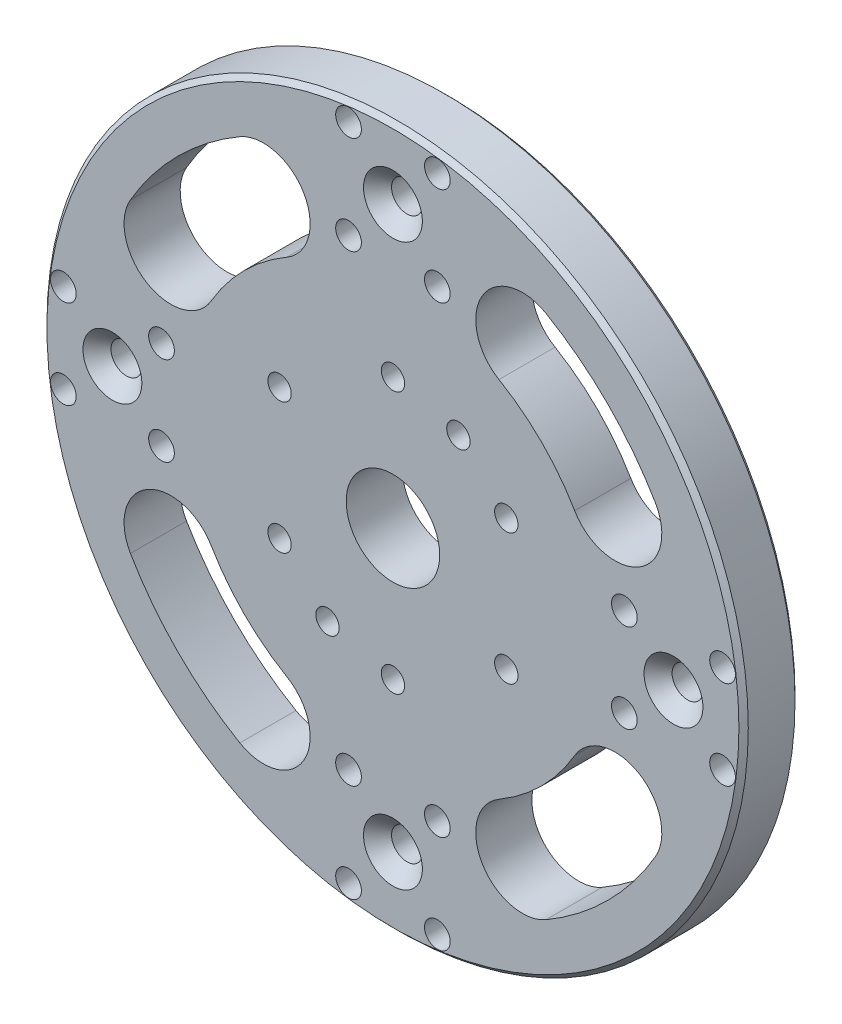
ISO-10303-21;
HEADER;
FILE_DESCRIPTION(('STEP AP214'),'2;1');
FILE_NAME('part.step','',(''),(''),'','','');
FILE_SCHEMA(('AUTOMOTIVE_DESIGN { 1 0 10303 214 1 1 1 1 }'));
ENDSEC;
DATA;
#1=APPLICATION_CONTEXT('core data for automotive mechanical design processes');
#2=APPLICATION_PROTOCOL_DEFINITION('international standard','automotive_design',2000,#1);
#3=PRODUCT_CONTEXT('',#1,'mechanical');
#4=PRODUCT('Part','Part','',(#3));
#5=PRODUCT_RELATED_PRODUCT_CATEGORY('part','',(#4));
#6=PRODUCT_DEFINITION_FORMATION('','',#4);
#7=PRODUCT_DEFINITION_CONTEXT('part definition',#1,'design');
#8=PRODUCT_DEFINITION('design','',#6,#7);
#9=PRODUCT_DEFINITION_SHAPE('','',#8);
#10=(LENGTH_UNIT() NAMED_UNIT(*) SI_UNIT(.MILLI.,.METRE.));
#11=(NAMED_UNIT(*) PLANE_ANGLE_UNIT() SI_UNIT($,.RADIAN.));
#12=(NAMED_UNIT(*) SI_UNIT($,.STERADIAN.) SOLID_ANGLE_UNIT());
#13=UNCERTAINTY_MEASURE_WITH_UNIT(LENGTH_MEASURE(1.E-05),#10,'distance_accuracy_value','');
#14=(GEOMETRIC_REPRESENTATION_CONTEXT(3) GLOBAL_UNCERTAINTY_ASSIGNED_CONTEXT((#13)) GLOBAL_UNIT_ASSIGNED_CONTEXT((#10,
#11,#12)) REPRESENTATION_CONTEXT('',''));
#15=CARTESIAN_POINT('',(0.,0.,0.));
#16=DIRECTION('',(0.,0.,1.));
#17=DIRECTION('',(1.,0.,0.));
#18=AXIS2_PLACEMENT_3D('',#15,#16,#17);
#19=CARTESIAN_POINT('',(0.,0.,0.));
#20=DIRECTION('',(0.,0.,1.));
#21=DIRECTION('',(1.,0.,0.));
#22=AXIS2_PLACEMENT_3D('',#19,#20,#21);
#23=PLANE('',#22);
#24=CARTESIAN_POINT('',(0.,0.,0.));
#25=DIRECTION('',(0.,0.,-1.));
#26=DIRECTION('',(-1.,0.,0.));
#27=AXIS2_PLACEMENT_3D('',#24,#25,#26);
#28=CIRCLE('',#27,64.9999999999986);
#29=CARTESIAN_POINT('',(56.1473948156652,-32.7485886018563,0.));
#30=VERTEX_POINT('',#29);
#31=CARTESIAN_POINT('',(32.7485886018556,-56.1473948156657,0.));
#32=VERTEX_POINT('',#31);
#33=EDGE_CURVE('E156',#30,#32,#28,.T.);
#34=ORIENTED_EDGE('',*,*,#33,.F.);
#35=CARTESIAN_POINT('',(47.5093340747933,-27.7103442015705,0.));
#36=DIRECTION('',(0.,0.,-1.));
#37=DIRECTION('',(-1.,0.,0.));
#38=AXIS2_PLACEMENT_3D('',#35,#36,#37);
#39=CIRCLE('',#38,9.99999999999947);
#40=CARTESIAN_POINT('',(38.8712733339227,-22.6720998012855,0.));
#41=VERTEX_POINT('',#40);
#42=EDGE_CURVE('E31',#41,#30,#39,.T.);
#43=ORIENTED_EDGE('',*,*,#42,.F.);
#44=CARTESIAN_POINT('',(0.,0.,0.));
#45=DIRECTION('',(0.,0.,1.));
#46=DIRECTION('',(-1.,0.,0.));
#47=AXIS2_PLACEMENT_3D('',#44,#45,#46);
#48=CIRCLE('',#47,45.);
#49=CARTESIAN_POINT('',(22.6720998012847,-38.8712733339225,0.));
#50=VERTEX_POINT('',#49);
#51=EDGE_CURVE('E147',#50,#41,#48,.T.);
#52=ORIENTED_EDGE('',*,*,#51,.F.);
#53=CARTESIAN_POINT('',(27.7103442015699,-47.5093340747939,0.));
#54=DIRECTION('',(0.,0.,-1.));
#55=DIRECTION('',(-1.,0.,0.));
#56=AXIS2_PLACEMENT_3D('',#53,#54,#55);
#57=CIRCLE('',#56,9.99999999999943);
#58=EDGE_CURVE('E150',#32,#50,#57,.T.);
#59=ORIENTED_EDGE('',*,*,#58,.F.);
#60=EDGE_LOOP('',(#34,#43,#52,#59));
#61=FACE_BOUND('',#60,.T.);
#62=CARTESIAN_POINT('',(0.,0.,0.));
#63=DIRECTION('',(0.,0.,-1.));
#64=DIRECTION('',(-1.,0.,0.));
#65=AXIS2_PLACEMENT_3D('',#62,#63,#64);
#66=CIRCLE('',#65,65.0000000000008);
#67=CARTESIAN_POINT('',(-32.748588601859,-56.1473948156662,0.));
#68=VERTEX_POINT('',#67);
#69=CARTESIAN_POINT('',(-56.1473948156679,-32.7485886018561,0.));
#70=VERTEX_POINT('',#69);
#71=EDGE_CURVE('E181',#68,#70,#66,.T.);
#72=ORIENTED_EDGE('',*,*,#71,.F.);
#73=CARTESIAN_POINT('',(-27.7103442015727,-47.5093340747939,0.));
#74=DIRECTION('',(0.,0.,-1.));
#75=DIRECTION('',(-1.,0.,0.));
#76=AXIS2_PLACEMENT_3D('',#73,#74,#75);
#77=CIRCLE('',#76,10.0000000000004);
#78=CARTESIAN_POINT('',(-22.6720998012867,-38.8712733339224,0.));
#79=VERTEX_POINT('',#78);
#80=EDGE_CURVE('E162',#79,#68,#77,.T.);
#81=ORIENTED_EDGE('',*,*,#80,.F.);
#82=CARTESIAN_POINT('',(0.,0.,0.));
#83=DIRECTION('',(0.,0.,1.));
#84=DIRECTION('',(-1.,0.,0.));
#85=AXIS2_PLACEMENT_3D('',#82,#83,#84);
#86=CIRCLE('',#85,45.);
#87=CARTESIAN_POINT('',(-38.8712733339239,-22.6720998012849,0.));
#88=VERTEX_POINT('',#87);
#89=EDGE_CURVE('E170',#88,#79,#86,.T.);
#90=ORIENTED_EDGE('',*,*,#89,.F.);
#91=CARTESIAN_POINT('',(-47.509334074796,-27.7103442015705,0.));
#92=DIRECTION('',(0.,0.,-1.));
#93=DIRECTION('',(-1.,0.,0.));
#94=AXIS2_PLACEMENT_3D('',#91,#92,#93);
#95=CIRCLE('',#94,10.0000000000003);
#96=EDGE_CURVE('E184',#70,#88,#95,.T.);
#97=ORIENTED_EDGE('',*,*,#96,.F.);
#98=EDGE_LOOP('',(#72,#81,#90,#97));
#99=FACE_BOUND('',#98,.T.);
#100=CARTESIAN_POINT('',(0.,0.,0.));
#101=DIRECTION('',(0.,0.,-1.));
#102=DIRECTION('',(-1.,0.,0.));
#103=AXIS2_PLACEMENT_3D('',#100,#101,#102);
#104=CIRCLE('',#103,65.0000000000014);
#105=CARTESIAN_POINT('',(-56.1473948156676,32.7485886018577,0.));
#106=VERTEX_POINT('',#105);
#107=CARTESIAN_POINT('',(-32.7485886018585,56.1473948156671,0.));
#108=VERTEX_POINT('',#107);
#109=EDGE_CURVE('E213',#106,#108,#104,.T.);
#110=ORIENTED_EDGE('',*,*,#109,.F.);
#111=CARTESIAN_POINT('',(-47.509334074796,27.7103442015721,0.));
#112=DIRECTION('',(0.,0.,-1.));
#113=DIRECTION('',(-1.,0.,0.));
#114=AXIS2_PLACEMENT_3D('',#111,#112,#113);
#115=CIRCLE('',#114,10.0000000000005);
#116=CARTESIAN_POINT('',(-38.8712733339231,22.6720998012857,0.));
#117=VERTEX_POINT('',#116);
#118=EDGE_CURVE('E191',#117,#106,#115,.T.);
#119=ORIENTED_EDGE('',*,*,#118,.F.);
#120=CARTESIAN_POINT('',(0.,0.,0.));
#121=DIRECTION('',(0.,0.,1.));
#122=DIRECTION('',(-1.,0.,0.));
#123=AXIS2_PLACEMENT_3D('',#120,#121,#122);
#124=CIRCLE('',#123,45.);
#125=CARTESIAN_POINT('',(-22.6720998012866,38.8712733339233,0.));
#126=VERTEX_POINT('',#125);
#127=EDGE_CURVE('E202',#126,#117,#124,.T.);
#128=ORIENTED_EDGE('',*,*,#127,.F.);
#129=CARTESIAN_POINT('',(-27.7103442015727,47.5093340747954,0.));
#130=DIRECTION('',(0.,0.,-1.));
#131=DIRECTION('',(-1.,0.,0.));
#132=AXIS2_PLACEMENT_3D('',#129,#130,#131);
#133=CIRCLE('',#132,10.0000000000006);
#134=EDGE_CURVE('E216',#108,#126,#133,.T.);
#135=ORIENTED_EDGE('',*,*,#134,.F.);
#136=EDGE_LOOP('',(#110,#119,#128,#135));
#137=FACE_BOUND('',#136,.T.);
#138=CARTESIAN_POINT('',(0.,0.,0.));
#139=DIRECTION('',(0.,0.,-1.));
#140=DIRECTION('',(-1.,0.,0.));
#141=AXIS2_PLACEMENT_3D('',#138,#139,#140);
#142=CIRCLE('',#141,64.9999999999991);
#143=CARTESIAN_POINT('',(32.7485886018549,56.1473948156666,0.));
#144=VERTEX_POINT('',#143);
#145=CARTESIAN_POINT('',(56.1473948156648,32.748588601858,0.));
#146=VERTEX_POINT('',#145);
#147=EDGE_CURVE('E245',#144,#146,#142,.T.);
#148=ORIENTED_EDGE('',*,*,#147,.F.);
#149=CARTESIAN_POINT('',(27.7103442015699,47.5093340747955,0.));
#150=DIRECTION('',(0.,0.,-1.));
#151=DIRECTION('',(-1.,0.,0.));
#152=AXIS2_PLACEMENT_3D('',#149,#150,#151);
#153=CIRCLE('',#152,9.99999999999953);
#154=CARTESIAN_POINT('',(22.6720998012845,38.8712733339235,0.));
#155=VERTEX_POINT('',#154);
#156=EDGE_CURVE('E223',#155,#144,#153,.T.);
#157=ORIENTED_EDGE('',*,*,#156,.F.);
#158=CARTESIAN_POINT('',(0.,0.,0.));
#159=DIRECTION('',(0.,0.,1.));
#160=DIRECTION('',(-1.,0.,0.));
#161=AXIS2_PLACEMENT_3D('',#158,#159,#160);
#162=CIRCLE('',#161,45.);
#163=CARTESIAN_POINT('',(38.8712733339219,22.6720998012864,0.));
#164=VERTEX_POINT('',#163);
#165=EDGE_CURVE('E234',#164,#155,#162,.T.);
#166=ORIENTED_EDGE('',*,*,#165,.F.);
#167=CARTESIAN_POINT('',(47.5093340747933,27.7103442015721,0.));
#168=DIRECTION('',(0.,0.,-1.));
#169=DIRECTION('',(-1.,0.,0.));
#170=AXIS2_PLACEMENT_3D('',#167,#168,#169);
#171=CIRCLE('',#170,9.99999999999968);
#172=EDGE_CURVE('E248',#146,#164,#171,.T.);
#173=ORIENTED_EDGE('',*,*,#172,.F.);
#174=EDGE_LOOP('',(#148,#157,#166,#173));
#175=FACE_BOUND('',#174,.T.);
#176=CARTESIAN_POINT('',(14.,24.2487113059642,0.));
#177=DIRECTION('',(0.,0.,-1.));
#178=DIRECTION('',(-1.,0.,0.));
#179=AXIS2_PLACEMENT_3D('',#176,#177,#178);
#180=CIRCLE('',#179,2.5);
#181=CARTESIAN_POINT('',(11.5,24.2487113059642,0.));
#182=VERTEX_POINT('',#181);
#183=EDGE_CURVE('E255',#182,#182,#180,.T.);
#184=ORIENTED_EDGE('',*,*,#183,.F.);
#185=EDGE_LOOP('',(#184));
#186=FACE_BOUND('',#185,.T.);
#187=CARTESIAN_POINT('',(-14.,-24.2487113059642,0.));
#188=DIRECTION('',(0.,0.,-1.));
#189=DIRECTION('',(-1.,0.,0.));
#190=AXIS2_PLACEMENT_3D('',#187,#188,#189);
#191=CIRCLE('',#190,2.5);
#192=CARTESIAN_POINT('',(-16.5,-24.2487113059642,0.));
#193=VERTEX_POINT('',#192);
#194=EDGE_CURVE('E267',#193,#193,#191,.T.);
#195=ORIENTED_EDGE('',*,*,#194,.F.);
#196=EDGE_LOOP('',(#195));
#197=FACE_BOUND('',#196,.T.);
#198=CARTESIAN_POINT('',(0.,28.,0.));
#199=DIRECTION('',(0.,0.,-1.));
#200=DIRECTION('',(-1.,0.,0.));
#201=AXIS2_PLACEMENT_3D('',#198,#199,#200);
#202=CIRCLE('',#201,2.5);
#203=CARTESIAN_POINT('',(-2.5,28.,0.));
#204=VERTEX_POINT('',#203);
#205=EDGE_CURVE('E273',#204,#204,#202,.T.);
#206=ORIENTED_EDGE('',*,*,#205,.F.);
#207=EDGE_LOOP('',(#206));
#208=FACE_BOUND('',#207,.T.);
#209=CARTESIAN_POINT('',(-24.2487113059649,14.000000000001,0.));
#210=DIRECTION('',(0.,0.,-1.));
#211=DIRECTION('',(-1.,0.,0.));
#212=AXIS2_PLACEMENT_3D('',#209,#210,#211);
#213=CIRCLE('',#212,2.5);
#214=CARTESIAN_POINT('',(-26.7487113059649,14.000000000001,0.));
#215=VERTEX_POINT('',#214);
#216=EDGE_CURVE('E279',#215,#215,#213,.T.);
#217=ORIENTED_EDGE('',*,*,#216,.F.);
#218=EDGE_LOOP('',(#217));
#219=FACE_BOUND('',#218,.T.);
#220=CARTESIAN_POINT('',(-24.2487113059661,-13.999999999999,0.));
#221=DIRECTION('',(0.,0.,-1.));
#222=DIRECTION('',(-1.,0.,0.));
#223=AXIS2_PLACEMENT_3D('',#220,#221,#222);
#224=CIRCLE('',#223,2.5);
#225=CARTESIAN_POINT('',(-26.748711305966,-13.999999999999,0.));
#226=VERTEX_POINT('',#225);
#227=EDGE_CURVE('E285',#226,#226,#224,.T.);
#228=ORIENTED_EDGE('',*,*,#227,.F.);
#229=EDGE_LOOP('',(#228));
#230=FACE_BOUND('',#229,.T.);
#231=CARTESIAN_POINT('',(-2.38056557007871E-12,-28.,0.));
#232=DIRECTION('',(0.,0.,-1.));
#233=DIRECTION('',(-1.,0.,0.));
#234=AXIS2_PLACEMENT_3D('',#231,#232,#233);
#235=CIRCLE('',#234,2.5);
#236=CARTESIAN_POINT('',(-2.50000000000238,-28.,0.));
#237=VERTEX_POINT('',#236);
#238=EDGE_CURVE('E291',#237,#237,#235,.T.);
#239=ORIENTED_EDGE('',*,*,#238,.F.);
#240=EDGE_LOOP('',(#239));
#241=FACE_BOUND('',#240,.T.);
#242=CARTESIAN_POINT('',(24.2487113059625,-14.000000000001,0.));
#243=DIRECTION('',(0.,0.,-1.));
#244=DIRECTION('',(-1.,0.,0.));
#245=AXIS2_PLACEMENT_3D('',#242,#243,#244);
#246=CIRCLE('',#245,2.5);
#247=CARTESIAN_POINT('',(21.7487113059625,-14.000000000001,0.));
#248=VERTEX_POINT('',#247);
#249=EDGE_CURVE('E297',#248,#248,#246,.T.);
#250=ORIENTED_EDGE('',*,*,#249,.F.);
#251=EDGE_LOOP('',(#250));
#252=FACE_BOUND('',#251,.T.);
#253=CARTESIAN_POINT('',(-70.5,-9.50000000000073,0.));
#254=DIRECTION('',(0.,0.,-1.));
#255=DIRECTION('',(-1.,0.,0.));
#256=AXIS2_PLACEMENT_3D('',#253,#254,#255);
#257=CIRCLE('',#256,2.75);
#258=CARTESIAN_POINT('',(-73.25,-9.50000000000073,0.));
#259=VERTEX_POINT('',#258);
#260=EDGE_CURVE('E321',#259,#259,#257,.T.);
#261=ORIENTED_EDGE('',*,*,#260,.F.);
#262=EDGE_LOOP('',(#261));
#263=FACE_BOUND('',#262,.T.);
#264=CARTESIAN_POINT('',(9.5,49.5,0.));
#265=DIRECTION('',(0.,0.,-1.));
#266=DIRECTION('',(-1.,0.,0.));
#267=AXIS2_PLACEMENT_3D('',#264,#265,#266);
#268=CIRCLE('',#267,2.75);
#269=CARTESIAN_POINT('',(6.75,49.5,0.));
#270=VERTEX_POINT('',#269);
#271=EDGE_CURVE('E333',#270,#270,#268,.T.);
#272=ORIENTED_EDGE('',*,*,#271,.F.);
#273=EDGE_LOOP('',(#272));
#274=FACE_BOUND('',#273,.T.);
#275=CARTESIAN_POINT('',(-9.5,70.5,0.));
#276=DIRECTION('',(0.,0.,-1.));
#277=DIRECTION('',(-1.,0.,0.));
#278=AXIS2_PLACEMENT_3D('',#275,#276,#277);
#279=CIRCLE('',#278,2.75);
#280=CARTESIAN_POINT('',(-12.25,70.5,0.));
#281=VERTEX_POINT('',#280);
#282=EDGE_CURVE('E345',#281,#281,#279,.T.);
#283=ORIENTED_EDGE('',*,*,#282,.F.);
#284=EDGE_LOOP('',(#283));
#285=FACE_BOUND('',#284,.T.);
#286=CARTESIAN_POINT('',(-9.5,49.5,0.));
#287=DIRECTION('',(0.,0.,-1.));
#288=DIRECTION('',(-1.,0.,0.));
#289=AXIS2_PLACEMENT_3D('',#286,#287,#288);
#290=CIRCLE('',#289,2.75);
#291=CARTESIAN_POINT('',(-12.25,49.5,0.));
#292=VERTEX_POINT('',#291);
#293=EDGE_CURVE('E351',#292,#292,#290,.T.);
#294=ORIENTED_EDGE('',*,*,#293,.F.);
#295=EDGE_LOOP('',(#294));
#296=FACE_BOUND('',#295,.T.);
#297=CARTESIAN_POINT('',(70.5,-9.49999999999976,0.));
#298=DIRECTION('',(0.,0.,-1.));
#299=DIRECTION('',(-1.,0.,0.));
#300=AXIS2_PLACEMENT_3D('',#297,#298,#299);
#301=CIRCLE('',#300,2.75);
#302=CARTESIAN_POINT('',(67.75,-9.49999999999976,0.));
#303=VERTEX_POINT('',#302);
#304=EDGE_CURVE('E363',#303,#303,#301,.T.);
#305=ORIENTED_EDGE('',*,*,#304,.F.);
#306=EDGE_LOOP('',(#305));
#307=FACE_BOUND('',#306,.T.);
#308=CARTESIAN_POINT('',(49.5,9.50000000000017,0.));
#309=DIRECTION('',(0.,0.,-1.));
#310=DIRECTION('',(-1.,0.,0.));
#311=AXIS2_PLACEMENT_3D('',#308,#309,#310);
#312=CIRCLE('',#311,2.75);
#313=CARTESIAN_POINT('',(46.75,9.50000000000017,0.));
#314=VERTEX_POINT('',#313);
#315=EDGE_CURVE('E375',#314,#314,#312,.T.);
#316=ORIENTED_EDGE('',*,*,#315,.F.);
#317=EDGE_LOOP('',(#316));
#318=FACE_BOUND('',#317,.T.);
#319=CARTESIAN_POINT('',(-9.5,-49.5,0.));
#320=DIRECTION('',(0.,0.,-1.));
#321=DIRECTION('',(-1.,0.,0.));
#322=AXIS2_PLACEMENT_3D('',#319,#320,#321);
#323=CIRCLE('',#322,2.75);
#324=CARTESIAN_POINT('',(-12.25,-49.5,0.));
#325=VERTEX_POINT('',#324);
#326=EDGE_CURVE('E381',#325,#325,#323,.T.);
#327=ORIENTED_EDGE('',*,*,#326,.F.);
#328=EDGE_LOOP('',(#327));
#329=FACE_BOUND('',#328,.T.);
#330=CARTESIAN_POINT('',(9.5,-70.5,0.));
#331=DIRECTION('',(0.,0.,-1.));
#332=DIRECTION('',(-1.,0.,0.));
#333=AXIS2_PLACEMENT_3D('',#330,#331,#332);
#334=CIRCLE('',#333,2.75);
#335=CARTESIAN_POINT('',(6.75,-70.5,0.));
#336=VERTEX_POINT('',#335);
#337=EDGE_CURVE('E393',#336,#336,#334,.T.);
#338=ORIENTED_EDGE('',*,*,#337,.F.);
#339=EDGE_LOOP('',(#338));
#340=FACE_BOUND('',#339,.T.);
#341=CARTESIAN_POINT('',(9.5,-49.5,0.));
#342=DIRECTION('',(0.,0.,-1.));
#343=DIRECTION('',(-1.,0.,0.));
#344=AXIS2_PLACEMENT_3D('',#341,#342,#343);
#345=CIRCLE('',#344,2.75);
#346=CARTESIAN_POINT('',(6.75,-49.5,0.));
#347=VERTEX_POINT('',#346);
#348=EDGE_CURVE('E399',#347,#347,#345,.T.);
#349=ORIENTED_EDGE('',*,*,#348,.F.);
#350=EDGE_LOOP('',(#349));
#351=FACE_BOUND('',#350,.T.);
#352=CARTESIAN_POINT('',(0.,0.,0.));
#353=DIRECTION('',(0.,0.,1.));
#354=DIRECTION('',(1.,0.,0.));
#355=AXIS2_PLACEMENT_3D('',#352,#353,#354);
#356=CIRCLE('',#355,74.);
#357=CARTESIAN_POINT('',(74.,0.,0.));
#358=VERTEX_POINT('',#357);
#359=EDGE_CURVE('E11',#358,#358,#356,.F.);
#360=ORIENTED_EDGE('',*,*,#359,.T.);
#361=EDGE_LOOP('',(#360));
#362=FACE_BOUND('',#361,.T.);
#363=CARTESIAN_POINT('',(0.,0.,0.));
#364=DIRECTION('',(0.,0.,1.));
#365=DIRECTION('',(1.,0.,0.));
#366=AXIS2_PLACEMENT_3D('',#363,#364,#365);
#367=CIRCLE('',#366,10.);
#368=CARTESIAN_POINT('',(10.,0.,0.));
#369=VERTEX_POINT('',#368);
#370=EDGE_CURVE('E406',#369,#369,#367,.T.);
#371=ORIENTED_EDGE('',*,*,#370,.T.);
#372=EDGE_LOOP('',(#371));
#373=FACE_BOUND('',#372,.T.);
#374=CARTESIAN_POINT('',(-60.,6.28466640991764E-13,0.));
#375=DIRECTION('',(0.,0.,-1.));
#376=DIRECTION('',(0.,-1.,0.));
#377=AXIS2_PLACEMENT_3D('',#374,#375,#376);
#378=CIRCLE('',#377,11.);
#379=CARTESIAN_POINT('',(-60.0000000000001,-10.9999999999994,0.));
#380=VERTEX_POINT('',#379);
#381=EDGE_CURVE('E409',#380,#380,#378,.T.);
#382=ORIENTED_EDGE('',*,*,#381,.F.);
#383=EDGE_LOOP('',(#382));
#384=FACE_BOUND('',#383,.T.);
#385=CARTESIAN_POINT('',(0.,-60.,0.));
#386=DIRECTION('',(0.,0.,-1.));
#387=DIRECTION('',(1.,0.,0.));
#388=AXIS2_PLACEMENT_3D('',#385,#386,#387);
#389=CIRCLE('',#388,11.);
#390=CARTESIAN_POINT('',(11.,-60.,0.));
#391=VERTEX_POINT('',#390);
#392=EDGE_CURVE('E422',#391,#391,#389,.T.);
#393=ORIENTED_EDGE('',*,*,#392,.F.);
#394=EDGE_LOOP('',(#393));
#395=FACE_BOUND('',#394,.T.);
#396=CARTESIAN_POINT('',(60.,-2.09488880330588E-13,0.));
#397=DIRECTION('',(0.,0.,-1.));
#398=DIRECTION('',(0.,1.,0.));
#399=AXIS2_PLACEMENT_3D('',#396,#397,#398);
#400=CIRCLE('',#399,11.);
#401=CARTESIAN_POINT('',(60.,10.9999999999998,0.));
#402=VERTEX_POINT('',#401);
#403=EDGE_CURVE('E429',#402,#402,#400,.T.);
#404=ORIENTED_EDGE('',*,*,#403,.F.);
#405=EDGE_LOOP('',(#404));
#406=FACE_BOUND('',#405,.T.);
#407=CARTESIAN_POINT('',(0.,60.,0.));
#408=DIRECTION('',(0.,0.,-1.));
#409=DIRECTION('',(-1.,0.,0.));
#410=AXIS2_PLACEMENT_3D('',#407,#408,#409);
#411=CIRCLE('',#410,11.);
#412=CARTESIAN_POINT('',(-11.,60.,0.));
#413=VERTEX_POINT('',#412);
#414=EDGE_CURVE('E436',#413,#413,#411,.T.);
#415=ORIENTED_EDGE('',*,*,#414,.F.);
#416=EDGE_LOOP('',(#415));
#417=FACE_BOUND('',#416,.T.);
#418=CARTESIAN_POINT('',(-9.5,-70.5,0.));
#419=DIRECTION('',(0.,0.,-1.));
#420=DIRECTION('',(-1.,0.,0.));
#421=AXIS2_PLACEMENT_3D('',#418,#419,#420);
#422=CIRCLE('',#421,2.75);
#423=CARTESIAN_POINT('',(-12.25,-70.5,0.));
#424=VERTEX_POINT('',#423);
#425=EDGE_CURVE('E387',#424,#424,#422,.T.);
#426=ORIENTED_EDGE('',*,*,#425,.F.);
#427=EDGE_LOOP('',(#426));
#428=FACE_BOUND('',#427,.T.);
#429=CARTESIAN_POINT('',(70.5,9.50000000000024,0.));
#430=DIRECTION('',(0.,0.,-1.));
#431=DIRECTION('',(-1.,0.,0.));
#432=AXIS2_PLACEMENT_3D('',#429,#430,#431);
#433=CIRCLE('',#432,2.75);
#434=CARTESIAN_POINT('',(67.75,9.50000000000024,0.));
#435=VERTEX_POINT('',#434);
#436=EDGE_CURVE('E369',#435,#435,#433,.T.);
#437=ORIENTED_EDGE('',*,*,#436,.F.);
#438=EDGE_LOOP('',(#437));
#439=FACE_BOUND('',#438,.T.);
#440=CARTESIAN_POINT('',(49.5,-9.49999999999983,0.));
#441=DIRECTION('',(0.,0.,-1.));
#442=DIRECTION('',(-1.,0.,0.));
#443=AXIS2_PLACEMENT_3D('',#440,#441,#442);
#444=CIRCLE('',#443,2.75);
#445=CARTESIAN_POINT('',(46.75,-9.49999999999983,0.));
#446=VERTEX_POINT('',#445);
#447=EDGE_CURVE('E357',#446,#446,#444,.T.);
#448=ORIENTED_EDGE('',*,*,#447,.F.);
#449=EDGE_LOOP('',(#448));
#450=FACE_BOUND('',#449,.T.);
#451=CARTESIAN_POINT('',(9.5,70.5,0.));
#452=DIRECTION('',(0.,0.,-1.));
#453=DIRECTION('',(-1.,0.,0.));
#454=AXIS2_PLACEMENT_3D('',#451,#452,#453);
#455=CIRCLE('',#454,2.75);
#456=CARTESIAN_POINT('',(6.75,70.5,0.));
#457=VERTEX_POINT('',#456);
#458=EDGE_CURVE('E339',#457,#457,#455,.T.);
#459=ORIENTED_EDGE('',*,*,#458,.F.);
#460=EDGE_LOOP('',(#459));
#461=FACE_BOUND('',#460,.T.);
#462=CARTESIAN_POINT('',(-49.5,-9.50000000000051,0.));
#463=DIRECTION('',(0.,0.,-1.));
#464=DIRECTION('',(-1.,0.,0.));
#465=AXIS2_PLACEMENT_3D('',#462,#463,#464);
#466=CIRCLE('',#465,2.75);
#467=CARTESIAN_POINT('',(-52.25,-9.50000000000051,0.));
#468=VERTEX_POINT('',#467);
#469=EDGE_CURVE('E327',#468,#468,#466,.T.);
#470=ORIENTED_EDGE('',*,*,#469,.F.);
#471=EDGE_LOOP('',(#470));
#472=FACE_BOUND('',#471,.T.);
#473=CARTESIAN_POINT('',(-70.5,9.49999999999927,0.));
#474=DIRECTION('',(0.,0.,-1.));
#475=DIRECTION('',(-1.,0.,0.));
#476=AXIS2_PLACEMENT_3D('',#473,#474,#475);
#477=CIRCLE('',#476,2.75);
#478=CARTESIAN_POINT('',(-73.25,9.49999999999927,0.));
#479=VERTEX_POINT('',#478);
#480=EDGE_CURVE('E315',#479,#479,#477,.T.);
#481=ORIENTED_EDGE('',*,*,#480,.F.);
#482=EDGE_LOOP('',(#481));
#483=FACE_BOUND('',#482,.T.);
#484=CARTESIAN_POINT('',(-49.5,9.49999999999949,0.));
#485=DIRECTION('',(0.,0.,-1.));
#486=DIRECTION('',(-1.,0.,0.));
#487=AXIS2_PLACEMENT_3D('',#484,#485,#486);
#488=CIRCLE('',#487,2.75);
#489=CARTESIAN_POINT('',(-52.25,9.49999999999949,0.));
#490=VERTEX_POINT('',#489);
#491=EDGE_CURVE('E309',#490,#490,#488,.T.);
#492=ORIENTED_EDGE('',*,*,#491,.F.);
#493=EDGE_LOOP('',(#492));
#494=FACE_BOUND('',#493,.T.);
#495=CARTESIAN_POINT('',(24.2487113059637,13.999999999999,0.));
#496=DIRECTION('',(0.,0.,-1.));
#497=DIRECTION('',(-1.,0.,0.));
#498=AXIS2_PLACEMENT_3D('',#495,#496,#497);
#499=CIRCLE('',#498,2.5);
#500=CARTESIAN_POINT('',(21.7487113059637,13.999999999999,0.));
#501=VERTEX_POINT('',#500);
#502=EDGE_CURVE('E303',#501,#501,#499,.T.);
#503=ORIENTED_EDGE('',*,*,#502,.F.);
#504=EDGE_LOOP('',(#503));
#505=FACE_BOUND('',#504,.T.);
#506=ADVANCED_FACE('F16',(#61,#99,#137,#175,#186,#197,#208,#219,#230,#241,#252,#263,#274,#285,
#296,#307,#318,#329,#340,#351,#362,#373,#384,#395,#406,#417,#428,#439,#450,#461,#472,#483,#494,
#505),#23,.F.);
#507=CARTESIAN_POINT('',(0.,0.,12.));
#508=DIRECTION('',(0.,0.,1.));
#509=DIRECTION('',(1.,0.,0.));
#510=AXIS2_PLACEMENT_3D('',#507,#508,#509);
#511=PLANE('',#510);
#512=CARTESIAN_POINT('',(47.5093340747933,-27.7103442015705,12.));
#513=DIRECTION('',(0.,0.,-1.));
#514=DIRECTION('',(-1.,0.,0.));
#515=AXIS2_PLACEMENT_3D('',#512,#513,#514);
#516=CIRCLE('',#515,9.99999999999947);
#517=CARTESIAN_POINT('',(38.8712733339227,-22.6720998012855,12.));
#518=VERTEX_POINT('',#517);
#519=CARTESIAN_POINT('',(56.1473948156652,-32.7485886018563,12.));
#520=VERTEX_POINT('',#519);
#521=EDGE_CURVE('E131',#518,#520,#516,.T.);
#522=ORIENTED_EDGE('',*,*,#521,.T.);
#523=CARTESIAN_POINT('',(0.,0.,12.));
#524=DIRECTION('',(0.,0.,-1.));
#525=DIRECTION('',(-1.,0.,0.));
#526=AXIS2_PLACEMENT_3D('',#523,#524,#525);
#527=CIRCLE('',#526,64.9999999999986);
#528=CARTESIAN_POINT('',(32.7485886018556,-56.1473948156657,12.));
#529=VERTEX_POINT('',#528);
#530=EDGE_CURVE('E140',#520,#529,#527,.T.);
#531=ORIENTED_EDGE('',*,*,#530,.T.);
#532=CARTESIAN_POINT('',(27.7103442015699,-47.5093340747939,12.));
#533=DIRECTION('',(0.,0.,-1.));
#534=DIRECTION('',(-1.,0.,0.));
#535=AXIS2_PLACEMENT_3D('',#532,#533,#534);
#536=CIRCLE('',#535,9.99999999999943);
#537=CARTESIAN_POINT('',(22.6720998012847,-38.8712733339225,12.));
#538=VERTEX_POINT('',#537);
#539=EDGE_CURVE('E39',#529,#538,#536,.T.);
#540=ORIENTED_EDGE('',*,*,#539,.T.);
#541=CARTESIAN_POINT('',(0.,0.,12.));
#542=DIRECTION('',(0.,0.,1.));
#543=DIRECTION('',(-1.,0.,0.));
#544=AXIS2_PLACEMENT_3D('',#541,#542,#543);
#545=CIRCLE('',#544,45.);
#546=EDGE_CURVE('E137',#538,#518,#545,.T.);
#547=ORIENTED_EDGE('',*,*,#546,.T.);
#548=EDGE_LOOP('',(#522,#531,#540,#547));
#549=FACE_BOUND('',#548,.T.);
#550=CARTESIAN_POINT('',(-27.7103442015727,-47.5093340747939,12.));
#551=DIRECTION('',(0.,0.,-1.));
#552=DIRECTION('',(-1.,0.,0.));
#553=AXIS2_PLACEMENT_3D('',#550,#551,#552);
#554=CIRCLE('',#553,10.0000000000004);
#555=CARTESIAN_POINT('',(-22.6720998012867,-38.8712733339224,12.));
#556=VERTEX_POINT('',#555);
#557=CARTESIAN_POINT('',(-32.748588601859,-56.1473948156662,12.));
#558=VERTEX_POINT('',#557);
#559=EDGE_CURVE('E166',#556,#558,#554,.T.);
#560=ORIENTED_EDGE('',*,*,#559,.T.);
#561=CARTESIAN_POINT('',(0.,0.,12.));
#562=DIRECTION('',(0.,0.,-1.));
#563=DIRECTION('',(-1.,0.,0.));
#564=AXIS2_PLACEMENT_3D('',#561,#562,#563);
#565=CIRCLE('',#564,65.0000000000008);
#566=CARTESIAN_POINT('',(-56.1473948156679,-32.7485886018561,12.));
#567=VERTEX_POINT('',#566);
#568=EDGE_CURVE('E169',#558,#567,#565,.T.);
#569=ORIENTED_EDGE('',*,*,#568,.T.);
#570=CARTESIAN_POINT('',(-47.509334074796,-27.7103442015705,12.));
#571=DIRECTION('',(0.,0.,-1.));
#572=DIRECTION('',(-1.,0.,0.));
#573=AXIS2_PLACEMENT_3D('',#570,#571,#572);
#574=CIRCLE('',#573,10.0000000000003);
#575=CARTESIAN_POINT('',(-38.8712733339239,-22.6720998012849,12.));
#576=VERTEX_POINT('',#575);
#577=EDGE_CURVE('E173',#567,#576,#574,.T.);
#578=ORIENTED_EDGE('',*,*,#577,.T.);
#579=CARTESIAN_POINT('',(0.,0.,12.));
#580=DIRECTION('',(0.,0.,1.));
#581=DIRECTION('',(-1.,0.,0.));
#582=AXIS2_PLACEMENT_3D('',#579,#580,#581);
#583=CIRCLE('',#582,45.);
#584=EDGE_CURVE('E176',#576,#556,#583,.T.);
#585=ORIENTED_EDGE('',*,*,#584,.T.);
#586=EDGE_LOOP('',(#560,#569,#578,#585));
#587=FACE_BOUND('',#586,.T.);
#588=CARTESIAN_POINT('',(-47.509334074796,27.7103442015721,12.));
#589=DIRECTION('',(0.,0.,-1.));
#590=DIRECTION('',(-1.,0.,0.));
#591=AXIS2_PLACEMENT_3D('',#588,#589,#590);
#592=CIRCLE('',#591,10.0000000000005);
#593=CARTESIAN_POINT('',(-38.8712733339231,22.6720998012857,12.));
#594=VERTEX_POINT('',#593);
#595=CARTESIAN_POINT('',(-56.1473948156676,32.7485886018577,12.));
#596=VERTEX_POINT('',#595);
#597=EDGE_CURVE('E198',#594,#596,#592,.T.);
#598=ORIENTED_EDGE('',*,*,#597,.T.);
#599=CARTESIAN_POINT('',(0.,0.,12.));
#600=DIRECTION('',(0.,0.,-1.));
#601=DIRECTION('',(-1.,0.,0.));
#602=AXIS2_PLACEMENT_3D('',#599,#600,#601);
#603=CIRCLE('',#602,65.0000000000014);
#604=CARTESIAN_POINT('',(-32.7485886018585,56.1473948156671,12.));
#605=VERTEX_POINT('',#604);
#606=EDGE_CURVE('E201',#596,#605,#603,.T.);
#607=ORIENTED_EDGE('',*,*,#606,.T.);
#608=CARTESIAN_POINT('',(-27.7103442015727,47.5093340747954,12.));
#609=DIRECTION('',(0.,0.,-1.));
#610=DIRECTION('',(-1.,0.,0.));
#611=AXIS2_PLACEMENT_3D('',#608,#609,#610);
#612=CIRCLE('',#611,10.0000000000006);
#613=CARTESIAN_POINT('',(-22.6720998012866,38.8712733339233,12.));
#614=VERTEX_POINT('',#613);
#615=EDGE_CURVE('E205',#605,#614,#612,.T.);
#616=ORIENTED_EDGE('',*,*,#615,.T.);
#617=CARTESIAN_POINT('',(0.,0.,12.));
#618=DIRECTION('',(0.,0.,1.));
#619=DIRECTION('',(-1.,0.,0.));
#620=AXIS2_PLACEMENT_3D('',#617,#618,#619);
#621=CIRCLE('',#620,45.);
#622=EDGE_CURVE('E208',#614,#594,#621,.T.);
#623=ORIENTED_EDGE('',*,*,#622,.T.);
#624=EDGE_LOOP('',(#598,#607,#616,#623));
#625=FACE_BOUND('',#624,.T.);
#626=CARTESIAN_POINT('',(27.7103442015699,47.5093340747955,12.));
#627=DIRECTION('',(0.,0.,-1.));
#628=DIRECTION('',(-1.,0.,0.));
#629=AXIS2_PLACEMENT_3D('',#626,#627,#628);
#630=CIRCLE('',#629,9.99999999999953);
#631=CARTESIAN_POINT('',(22.6720998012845,38.8712733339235,12.));
#632=VERTEX_POINT('',#631);
#633=CARTESIAN_POINT('',(32.7485886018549,56.1473948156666,12.));
#634=VERTEX_POINT('',#633);
#635=EDGE_CURVE('E230',#632,#634,#630,.T.);
#636=ORIENTED_EDGE('',*,*,#635,.T.);
#637=CARTESIAN_POINT('',(0.,0.,12.));
#638=DIRECTION('',(0.,0.,-1.));
#639=DIRECTION('',(-1.,0.,0.));
#640=AXIS2_PLACEMENT_3D('',#637,#638,#639);
#641=CIRCLE('',#640,64.9999999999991);
#642=CARTESIAN_POINT('',(56.1473948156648,32.748588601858,12.));
#643=VERTEX_POINT('',#642);
#644=EDGE_CURVE('E233',#634,#643,#641,.T.);
#645=ORIENTED_EDGE('',*,*,#644,.T.);
#646=CARTESIAN_POINT('',(47.5093340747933,27.7103442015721,12.));
#647=DIRECTION('',(0.,0.,-1.));
#648=DIRECTION('',(-1.,0.,0.));
#649=AXIS2_PLACEMENT_3D('',#646,#647,#648);
#650=CIRCLE('',#649,9.99999999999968);
#651=CARTESIAN_POINT('',(38.8712733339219,22.6720998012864,12.));
#652=VERTEX_POINT('',#651);
#653=EDGE_CURVE('E237',#643,#652,#650,.T.);
#654=ORIENTED_EDGE('',*,*,#653,.T.);
#655=CARTESIAN_POINT('',(0.,0.,12.));
#656=DIRECTION('',(0.,0.,1.));
#657=DIRECTION('',(-1.,0.,0.));
#658=AXIS2_PLACEMENT_3D('',#655,#656,#657);
#659=CIRCLE('',#658,45.);
#660=EDGE_CURVE('E240',#652,#632,#659,.T.);
#661=ORIENTED_EDGE('',*,*,#660,.T.);
#662=EDGE_LOOP('',(#636,#645,#654,#661));
#663=FACE_BOUND('',#662,.T.);
#664=CARTESIAN_POINT('',(14.,24.2487113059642,12.));
#665=DIRECTION('',(0.,0.,-1.));
#666=DIRECTION('',(-1.,0.,0.));
#667=AXIS2_PLACEMENT_3D('',#664,#665,#666);
#668=CIRCLE('',#667,2.5);
#669=CARTESIAN_POINT('',(11.5,24.2487113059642,12.));
#670=VERTEX_POINT('',#669);
#671=EDGE_CURVE('E264',#670,#670,#668,.T.);
#672=ORIENTED_EDGE('',*,*,#671,.T.);
#673=EDGE_LOOP('',(#672));
#674=FACE_BOUND('',#673,.T.);
#675=CARTESIAN_POINT('',(-14.,-24.2487113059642,12.));
#676=DIRECTION('',(0.,0.,-1.));
#677=DIRECTION('',(-1.,0.,0.));
#678=AXIS2_PLACEMENT_3D('',#675,#676,#677);
#679=CIRCLE('',#678,2.5);
#680=CARTESIAN_POINT('',(-16.5,-24.2487113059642,12.));
#681=VERTEX_POINT('',#680);
#682=EDGE_CURVE('E270',#681,#681,#679,.T.);
#683=ORIENTED_EDGE('',*,*,#682,.T.);
#684=EDGE_LOOP('',(#683));
#685=FACE_BOUND('',#684,.T.);
#686=CARTESIAN_POINT('',(0.,28.,12.));
#687=DIRECTION('',(0.,0.,-1.));
#688=DIRECTION('',(-1.,0.,0.));
#689=AXIS2_PLACEMENT_3D('',#686,#687,#688);
#690=CIRCLE('',#689,2.5);
#691=CARTESIAN_POINT('',(-2.5,28.,12.));
#692=VERTEX_POINT('',#691);
#693=EDGE_CURVE('E276',#692,#692,#690,.T.);
#694=ORIENTED_EDGE('',*,*,#693,.T.);
#695=EDGE_LOOP('',(#694));
#696=FACE_BOUND('',#695,.T.);
#697=CARTESIAN_POINT('',(-24.2487113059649,14.000000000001,12.));
#698=DIRECTION('',(0.,0.,-1.));
#699=DIRECTION('',(-1.,0.,0.));
#700=AXIS2_PLACEMENT_3D('',#697,#698,#699);
#701=CIRCLE('',#700,2.5);
#702=CARTESIAN_POINT('',(-26.7487113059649,14.000000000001,12.));
#703=VERTEX_POINT('',#702);
#704=EDGE_CURVE('E282',#703,#703,#701,.T.);
#705=ORIENTED_EDGE('',*,*,#704,.T.);
#706=EDGE_LOOP('',(#705));
#707=FACE_BOUND('',#706,.T.);
#708=CARTESIAN_POINT('',(-24.2487113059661,-13.999999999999,12.));
#709=DIRECTION('',(0.,0.,-1.));
#710=DIRECTION('',(-1.,0.,0.));
#711=AXIS2_PLACEMENT_3D('',#708,#709,#710);
#712=CIRCLE('',#711,2.5);
#713=CARTESIAN_POINT('',(-26.748711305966,-13.999999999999,12.));
#714=VERTEX_POINT('',#713);
#715=EDGE_CURVE('E288',#714,#714,#712,.T.);
#716=ORIENTED_EDGE('',*,*,#715,.T.);
#717=EDGE_LOOP('',(#716));
#718=FACE_BOUND('',#717,.T.);
#719=CARTESIAN_POINT('',(-2.38056557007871E-12,-28.,12.));
#720=DIRECTION('',(0.,0.,-1.));
#721=DIRECTION('',(-1.,0.,0.));
#722=AXIS2_PLACEMENT_3D('',#719,#720,#721);
#723=CIRCLE('',#722,2.5);
#724=CARTESIAN_POINT('',(-2.50000000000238,-28.,12.));
#725=VERTEX_POINT('',#724);
#726=EDGE_CURVE('E294',#725,#725,#723,.T.);
#727=ORIENTED_EDGE('',*,*,#726,.T.);
#728=EDGE_LOOP('',(#727));
#729=FACE_BOUND('',#728,.T.);
#730=CARTESIAN_POINT('',(24.2487113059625,-14.000000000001,12.));
#731=DIRECTION('',(0.,0.,-1.));
#732=DIRECTION('',(-1.,0.,0.));
#733=AXIS2_PLACEMENT_3D('',#730,#731,#732);
#734=CIRCLE('',#733,2.5);
#735=CARTESIAN_POINT('',(21.7487113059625,-14.000000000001,12.));
#736=VERTEX_POINT('',#735);
#737=EDGE_CURVE('E300',#736,#736,#734,.T.);
#738=ORIENTED_EDGE('',*,*,#737,.T.);
#739=EDGE_LOOP('',(#738));
#740=FACE_BOUND('',#739,.T.);
#741=CARTESIAN_POINT('',(24.2487113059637,13.999999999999,12.));
#742=DIRECTION('',(0.,0.,-1.));
#743=DIRECTION('',(-1.,0.,0.));
#744=AXIS2_PLACEMENT_3D('',#741,#742,#743);
#745=CIRCLE('',#744,2.5);
#746=CARTESIAN_POINT('',(21.7487113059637,13.999999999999,12.));
#747=VERTEX_POINT('',#746);
#748=EDGE_CURVE('E306',#747,#747,#745,.T.);
#749=ORIENTED_EDGE('',*,*,#748,.T.);
#750=EDGE_LOOP('',(#749));
#751=FACE_BOUND('',#750,.T.);
#752=CARTESIAN_POINT('',(-70.5,9.49999999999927,12.));
#753=DIRECTION('',(0.,0.,-1.));
#754=DIRECTION('',(-1.,0.,0.));
#755=AXIS2_PLACEMENT_3D('',#752,#753,#754);
#756=CIRCLE('',#755,2.75);
#757=CARTESIAN_POINT('',(-73.25,9.49999999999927,12.));
#758=VERTEX_POINT('',#757);
#759=EDGE_CURVE('E318',#758,#758,#756,.T.);
#760=ORIENTED_EDGE('',*,*,#759,.T.);
#761=EDGE_LOOP('',(#760));
#762=FACE_BOUND('',#761,.T.);
#763=CARTESIAN_POINT('',(9.5,49.5,12.));
#764=DIRECTION('',(0.,0.,-1.));
#765=DIRECTION('',(-1.,0.,0.));
#766=AXIS2_PLACEMENT_3D('',#763,#764,#765);
#767=CIRCLE('',#766,2.75);
#768=CARTESIAN_POINT('',(6.75,49.5,12.));
#769=VERTEX_POINT('',#768);
#770=EDGE_CURVE('E336',#769,#769,#767,.T.);
#771=ORIENTED_EDGE('',*,*,#770,.T.);
#772=EDGE_LOOP('',(#771));
#773=FACE_BOUND('',#772,.T.);
#774=CARTESIAN_POINT('',(9.5,70.5,12.));
#775=DIRECTION('',(0.,0.,-1.));
#776=DIRECTION('',(-1.,0.,0.));
#777=AXIS2_PLACEMENT_3D('',#774,#775,#776);
#778=CIRCLE('',#777,2.75);
#779=CARTESIAN_POINT('',(6.75,70.5,12.));
#780=VERTEX_POINT('',#779);
#781=EDGE_CURVE('E342',#780,#780,#778,.T.);
#782=ORIENTED_EDGE('',*,*,#781,.T.);
#783=EDGE_LOOP('',(#782));
#784=FACE_BOUND('',#783,.T.);
#785=CARTESIAN_POINT('',(70.5,-9.49999999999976,12.));
#786=DIRECTION('',(0.,0.,-1.));
#787=DIRECTION('',(-1.,0.,0.));
#788=AXIS2_PLACEMENT_3D('',#785,#786,#787);
#789=CIRCLE('',#788,2.75);
#790=CARTESIAN_POINT('',(67.75,-9.49999999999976,12.));
#791=VERTEX_POINT('',#790);
#792=EDGE_CURVE('E366',#791,#791,#789,.T.);
#793=ORIENTED_EDGE('',*,*,#792,.T.);
#794=EDGE_LOOP('',(#793));
#795=FACE_BOUND('',#794,.T.);
#796=CARTESIAN_POINT('',(0.,60.,12.));
#797=DIRECTION('',(0.,0.,1.));
#798=DIRECTION('',(1.,0.,0.));
#799=AXIS2_PLACEMENT_3D('',#796,#797,#798);
#800=CIRCLE('',#799,6.3);
#801=CARTESIAN_POINT('',(6.3,60.,12.));
#802=VERTEX_POINT('',#801);
#803=EDGE_CURVE('E457',#802,#802,#800,.T.);
#804=ORIENTED_EDGE('',*,*,#803,.F.);
#805=EDGE_LOOP('',(#804));
#806=FACE_BOUND('',#805,.T.);
#807=CARTESIAN_POINT('',(-60.,-2.09488880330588E-13,12.));
#808=DIRECTION('',(0.,0.,1.));
#809=DIRECTION('',(1.,0.,0.));
#810=AXIS2_PLACEMENT_3D('',#807,#808,#809);
#811=CIRCLE('',#810,6.3);
#812=CARTESIAN_POINT('',(-53.7,-2.09488880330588E-13,12.));
#813=VERTEX_POINT('',#812);
#814=EDGE_CURVE('E451',#813,#813,#811,.T.);
#815=ORIENTED_EDGE('',*,*,#814,.F.);
#816=EDGE_LOOP('',(#815));
#817=FACE_BOUND('',#816,.T.);
#818=CARTESIAN_POINT('',(0.,-60.,12.));
#819=DIRECTION('',(0.,0.,1.));
#820=DIRECTION('',(1.,0.,0.));
#821=AXIS2_PLACEMENT_3D('',#818,#819,#820);
#822=CIRCLE('',#821,6.3);
#823=CARTESIAN_POINT('',(6.3,-60.,12.));
#824=VERTEX_POINT('',#823);
#825=EDGE_CURVE('E445',#824,#824,#822,.T.);
#826=ORIENTED_EDGE('',*,*,#825,.F.);
#827=EDGE_LOOP('',(#826));
#828=FACE_BOUND('',#827,.T.);
#829=CARTESIAN_POINT('',(60.,6.28466640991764E-13,12.));
#830=DIRECTION('',(0.,0.,1.));
#831=DIRECTION('',(1.,0.,0.));
#832=AXIS2_PLACEMENT_3D('',#829,#830,#831);
#833=CIRCLE('',#832,6.3);
#834=CARTESIAN_POINT('',(66.3,6.28466640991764E-13,12.));
#835=VERTEX_POINT('',#834);
#836=EDGE_CURVE('E439',#835,#835,#833,.T.);
#837=ORIENTED_EDGE('',*,*,#836,.F.);
#838=EDGE_LOOP('',(#837));
#839=FACE_BOUND('',#838,.T.);
#840=CARTESIAN_POINT('',(0.,0.,12.));
#841=DIRECTION('',(0.,0.,1.));
#842=DIRECTION('',(1.,0.,0.));
#843=AXIS2_PLACEMENT_3D('',#840,#841,#842);
#844=CIRCLE('',#843,10.);
#845=CARTESIAN_POINT('',(10.,0.,12.));
#846=VERTEX_POINT('',#845);
#847=EDGE_CURVE('E405',#846,#846,#844,.T.);
#848=ORIENTED_EDGE('',*,*,#847,.F.);
#849=EDGE_LOOP('',(#848));
#850=FACE_BOUND('',#849,.T.);
#851=CARTESIAN_POINT('',(0.,0.,12.));
#852=DIRECTION('',(0.,0.,1.));
#853=DIRECTION('',(1.,0.,0.));
#854=AXIS2_PLACEMENT_3D('',#851,#852,#853);
#855=CIRCLE('',#854,74.);
#856=CARTESIAN_POINT('',(74.,0.,12.));
#857=VERTEX_POINT('',#856);
#858=EDGE_CURVE('E463',#857,#857,#855,.T.);
#859=ORIENTED_EDGE('',*,*,#858,.T.);
#860=EDGE_LOOP('',(#859));
#861=FACE_BOUND('',#860,.T.);
#862=CARTESIAN_POINT('',(9.5,-49.5,12.));
#863=DIRECTION('',(0.,0.,-1.));
#864=DIRECTION('',(-1.,0.,0.));
#865=AXIS2_PLACEMENT_3D('',#862,#863,#864);
#866=CIRCLE('',#865,2.75);
#867=CARTESIAN_POINT('',(6.75,-49.5,12.));
#868=VERTEX_POINT('',#867);
#869=EDGE_CURVE('E402',#868,#868,#866,.T.);
#870=ORIENTED_EDGE('',*,*,#869,.T.);
#871=EDGE_LOOP('',(#870));
#872=FACE_BOUND('',#871,.T.);
#873=CARTESIAN_POINT('',(9.5,-70.5,12.));
#874=DIRECTION('',(0.,0.,-1.));
#875=DIRECTION('',(-1.,0.,0.));
#876=AXIS2_PLACEMENT_3D('',#873,#874,#875);
#877=CIRCLE('',#876,2.75);
#878=CARTESIAN_POINT('',(6.75,-70.5,12.));
#879=VERTEX_POINT('',#878);
#880=EDGE_CURVE('E396',#879,#879,#877,.T.);
#881=ORIENTED_EDGE('',*,*,#880,.T.);
#882=EDGE_LOOP('',(#881));
#883=FACE_BOUND('',#882,.T.);
#884=CARTESIAN_POINT('',(-9.5,-70.5,12.));
#885=DIRECTION('',(0.,0.,-1.));
#886=DIRECTION('',(-1.,0.,0.));
#887=AXIS2_PLACEMENT_3D('',#884,#885,#886);
#888=CIRCLE('',#887,2.75);
#889=CARTESIAN_POINT('',(-12.25,-70.5,12.));
#890=VERTEX_POINT('',#889);
#891=EDGE_CURVE('E390',#890,#890,#888,.T.);
#892=ORIENTED_EDGE('',*,*,#891,.T.);
#893=EDGE_LOOP('',(#892));
#894=FACE_BOUND('',#893,.T.);
#895=CARTESIAN_POINT('',(-9.5,-49.5,12.));
#896=DIRECTION('',(0.,0.,-1.));
#897=DIRECTION('',(-1.,0.,0.));
#898=AXIS2_PLACEMENT_3D('',#895,#896,#897);
#899=CIRCLE('',#898,2.75);
#900=CARTESIAN_POINT('',(-12.25,-49.5,12.));
#901=VERTEX_POINT('',#900);
#902=EDGE_CURVE('E384',#901,#901,#899,.T.);
#903=ORIENTED_EDGE('',*,*,#902,.T.);
#904=EDGE_LOOP('',(#903));
#905=FACE_BOUND('',#904,.T.);
#906=CARTESIAN_POINT('',(49.5,9.50000000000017,12.));
#907=DIRECTION('',(0.,0.,-1.));
#908=DIRECTION('',(-1.,0.,0.));
#909=AXIS2_PLACEMENT_3D('',#906,#907,#908);
#910=CIRCLE('',#909,2.75);
#911=CARTESIAN_POINT('',(46.75,9.50000000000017,12.));
#912=VERTEX_POINT('',#911);
#913=EDGE_CURVE('E378',#912,#912,#910,.T.);
#914=ORIENTED_EDGE('',*,*,#913,.T.);
#915=EDGE_LOOP('',(#914));
#916=FACE_BOUND('',#915,.T.);
#917=CARTESIAN_POINT('',(70.5,9.50000000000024,12.));
#918=DIRECTION('',(0.,0.,-1.));
#919=DIRECTION('',(-1.,0.,0.));
#920=AXIS2_PLACEMENT_3D('',#917,#918,#919);
#921=CIRCLE('',#920,2.75);
#922=CARTESIAN_POINT('',(67.75,9.50000000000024,12.));
#923=VERTEX_POINT('',#922);
#924=EDGE_CURVE('E372',#923,#923,#921,.T.);
#925=ORIENTED_EDGE('',*,*,#924,.T.);
#926=EDGE_LOOP('',(#925));
#927=FACE_BOUND('',#926,.T.);
#928=CARTESIAN_POINT('',(49.5,-9.49999999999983,12.));
#929=DIRECTION('',(0.,0.,-1.));
#930=DIRECTION('',(-1.,0.,0.));
#931=AXIS2_PLACEMENT_3D('',#928,#929,#930);
#932=CIRCLE('',#931,2.75);
#933=CARTESIAN_POINT('',(46.75,-9.49999999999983,12.));
#934=VERTEX_POINT('',#933);
#935=EDGE_CURVE('E360',#934,#934,#932,.T.);
#936=ORIENTED_EDGE('',*,*,#935,.T.);
#937=EDGE_LOOP('',(#936));
#938=FACE_BOUND('',#937,.T.);
#939=CARTESIAN_POINT('',(-9.5,49.5,12.));
#940=DIRECTION('',(0.,0.,-1.));
#941=DIRECTION('',(-1.,0.,0.));
#942=AXIS2_PLACEMENT_3D('',#939,#940,#941);
#943=CIRCLE('',#942,2.75);
#944=CARTESIAN_POINT('',(-12.25,49.5,12.));
#945=VERTEX_POINT('',#944);
#946=EDGE_CURVE('E354',#945,#945,#943,.T.);
#947=ORIENTED_EDGE('',*,*,#946,.T.);
#948=EDGE_LOOP('',(#947));
#949=FACE_BOUND('',#948,.T.);
#950=CARTESIAN_POINT('',(-9.5,70.5,12.));
#951=DIRECTION('',(0.,0.,-1.));
#952=DIRECTION('',(-1.,0.,0.));
#953=AXIS2_PLACEMENT_3D('',#950,#951,#952);
#954=CIRCLE('',#953,2.75);
#955=CARTESIAN_POINT('',(-12.25,70.5,12.));
#956=VERTEX_POINT('',#955);
#957=EDGE_CURVE('E348',#956,#956,#954,.T.);
#958=ORIENTED_EDGE('',*,*,#957,.T.);
#959=EDGE_LOOP('',(#958));
#960=FACE_BOUND('',#959,.T.);
#961=CARTESIAN_POINT('',(-49.5,-9.50000000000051,12.));
#962=DIRECTION('',(0.,0.,-1.));
#963=DIRECTION('',(-1.,0.,0.));
#964=AXIS2_PLACEMENT_3D('',#961,#962,#963);
#965=CIRCLE('',#964,2.75);
#966=CARTESIAN_POINT('',(-52.25,-9.50000000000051,12.));
#967=VERTEX_POINT('',#966);
#968=EDGE_CURVE('E330',#967,#967,#965,.T.);
#969=ORIENTED_EDGE('',*,*,#968,.T.);
#970=EDGE_LOOP('',(#969));
#971=FACE_BOUND('',#970,.T.);
#972=CARTESIAN_POINT('',(-70.5,-9.50000000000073,12.));
#973=DIRECTION('',(0.,0.,-1.));
#974=DIRECTION('',(-1.,0.,0.));
#975=AXIS2_PLACEMENT_3D('',#972,#973,#974);
#976=CIRCLE('',#975,2.75);
#977=CARTESIAN_POINT('',(-73.25,-9.50000000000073,12.));
#978=VERTEX_POINT('',#977);
#979=EDGE_CURVE('E324',#978,#978,#976,.T.);
#980=ORIENTED_EDGE('',*,*,#979,.T.);
#981=EDGE_LOOP('',(#980));
#982=FACE_BOUND('',#981,.T.);
#983=CARTESIAN_POINT('',(-49.5,9.49999999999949,12.));
#984=DIRECTION('',(0.,0.,-1.));
#985=DIRECTION('',(-1.,0.,0.));
#986=AXIS2_PLACEMENT_3D('',#983,#984,#985);
#987=CIRCLE('',#986,2.75);
#988=CARTESIAN_POINT('',(-52.25,9.49999999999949,12.));
#989=VERTEX_POINT('',#988);
#990=EDGE_CURVE('E312',#989,#989,#987,.T.);
#991=ORIENTED_EDGE('',*,*,#990,.T.);
#992=EDGE_LOOP('',(#991));
#993=FACE_BOUND('',#992,.T.);
#994=ADVANCED_FACE('F144',(#549,#587,#625,#663,#674,#685,#696,#707,#718,#729,#740,#751,#762,
#773,#784,#795,#806,#817,#828,#839,#850,#861,#872,#883,#894,#905,#916,#927,#938,#949,#960,#971,
#982,#993),#511,.T.);
#995=CARTESIAN_POINT('',(-60.,-2.09488880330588E-13,12.));
#996=DIRECTION('',(0.,0.,1.));
#997=DIRECTION('',(1.,0.,0.));
#998=AXIS2_PLACEMENT_3D('',#995,#996,#997);
#999=CYLINDRICAL_SURFACE('',#998,3.3);
#1000=CARTESIAN_POINT('',(-60.,-2.09488880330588E-13,9.));
#1001=DIRECTION('',(0.,0.,1.));
#1002=DIRECTION('',(1.,0.,0.));
#1003=AXIS2_PLACEMENT_3D('',#1000,#1001,#1002);
#1004=CIRCLE('',#1003,3.3);
#1005=CARTESIAN_POINT('',(-56.7,-2.09488880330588E-13,9.));
#1006=VERTEX_POINT('',#1005);
#1007=EDGE_CURVE('E454',#1006,#1006,#1004,.T.);
#1008=ORIENTED_EDGE('',*,*,#1007,.T.);
#1009=EDGE_LOOP('',(#1008));
#1010=FACE_BOUND('',#1009,.T.);
#1011=CARTESIAN_POINT('',(-60.,-2.09488880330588E-13,4.));
#1012=DIRECTION('',(0.,0.,-1.));
#1013=DIRECTION('',(-1.,0.,0.));
#1014=AXIS2_PLACEMENT_3D('',#1011,#1012,#1013);
#1015=CIRCLE('',#1014,3.3);
#1016=CARTESIAN_POINT('',(-63.3,-2.09488880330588E-13,4.));
#1017=VERTEX_POINT('',#1016);
#1018=EDGE_CURVE('E415',#1017,#1017,#1015,.F.);
#1019=ORIENTED_EDGE('',*,*,#1018,.F.);
#1020=EDGE_LOOP('',(#1019));
#1021=FACE_BOUND('',#1020,.T.);
#1022=ADVANCED_FACE('F490',(#1010,#1021),#999,.F.);
#1023=CARTESIAN_POINT('',(0.,-60.,12.));
#1024=DIRECTION('',(0.,0.,1.));
#1025=DIRECTION('',(1.,0.,0.));
#1026=AXIS2_PLACEMENT_3D('',#1023,#1024,#1025);
#1027=CYLINDRICAL_SURFACE('',#1026,3.3);
#1028=CARTESIAN_POINT('',(0.,-60.,9.));
#1029=DIRECTION('',(0.,0.,1.));
#1030=DIRECTION('',(1.,0.,0.));
#1031=AXIS2_PLACEMENT_3D('',#1028,#1029,#1030);
#1032=CIRCLE('',#1031,3.3);
#1033=CARTESIAN_POINT('',(3.3,-60.,9.));
#1034=VERTEX_POINT('',#1033);
#1035=EDGE_CURVE('E448',#1034,#1034,#1032,.T.);
#1036=ORIENTED_EDGE('',*,*,#1035,.T.);
#1037=EDGE_LOOP('',(#1036));
#1038=FACE_BOUND('',#1037,.T.);
#1039=CARTESIAN_POINT('',(0.,-60.,4.));
#1040=DIRECTION('',(0.,0.,-1.));
#1041=DIRECTION('',(-1.,0.,0.));
#1042=AXIS2_PLACEMENT_3D('',#1039,#1040,#1041);
#1043=CIRCLE('',#1042,3.3);
#1044=CARTESIAN_POINT('',(-3.3,-60.,4.));
#1045=VERTEX_POINT('',#1044);
#1046=EDGE_CURVE('E421',#1045,#1045,#1043,.F.);
#1047=ORIENTED_EDGE('',*,*,#1046,.F.);
#1048=EDGE_LOOP('',(#1047));
#1049=FACE_BOUND('',#1048,.T.);
#1050=ADVANCED_FACE('F648',(#1038,#1049),#1027,.F.);
#1051=CARTESIAN_POINT('',(60.,6.28466640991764E-13,12.));
#1052=DIRECTION('',(0.,0.,1.));
#1053=DIRECTION('',(1.,0.,0.));
#1054=AXIS2_PLACEMENT_3D('',#1051,#1052,#1053);
#1055=CYLINDRICAL_SURFACE('',#1054,3.3);
#1056=CARTESIAN_POINT('',(60.,6.28466640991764E-13,9.));
#1057=DIRECTION('',(0.,0.,1.));
#1058=DIRECTION('',(1.,0.,0.));
#1059=AXIS2_PLACEMENT_3D('',#1056,#1057,#1058);
#1060=CIRCLE('',#1059,3.3);
#1061=CARTESIAN_POINT('',(63.3,6.28466640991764E-13,9.));
#1062=VERTEX_POINT('',#1061);
#1063=EDGE_CURVE('E442',#1062,#1062,#1060,.T.);
#1064=ORIENTED_EDGE('',*,*,#1063,.T.);
#1065=EDGE_LOOP('',(#1064));
#1066=FACE_BOUND('',#1065,.T.);
#1067=CARTESIAN_POINT('',(60.,6.28466640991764E-13,4.));
#1068=DIRECTION('',(0.,0.,-1.));
#1069=DIRECTION('',(-1.,0.,0.));
#1070=AXIS2_PLACEMENT_3D('',#1067,#1068,#1069);
#1071=CIRCLE('',#1070,3.3);
#1072=CARTESIAN_POINT('',(56.7,6.28466640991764E-13,4.));
#1073=VERTEX_POINT('',#1072);
#1074=EDGE_CURVE('E428',#1073,#1073,#1071,.F.);
#1075=ORIENTED_EDGE('',*,*,#1074,.F.);
#1076=EDGE_LOOP('',(#1075));
#1077=FACE_BOUND('',#1076,.T.);
#1078=ADVANCED_FACE('F644',(#1066,#1077),#1055,.F.);
#1079=CARTESIAN_POINT('',(0.,60.,12.));
#1080=DIRECTION('',(0.,0.,1.));
#1081=DIRECTION('',(1.,0.,0.));
#1082=AXIS2_PLACEMENT_3D('',#1079,#1080,#1081);
#1083=CYLINDRICAL_SURFACE('',#1082,3.3);
#1084=CARTESIAN_POINT('',(0.,60.,9.));
#1085=DIRECTION('',(0.,0.,1.));
#1086=DIRECTION('',(1.,0.,0.));
#1087=AXIS2_PLACEMENT_3D('',#1084,#1085,#1086);
#1088=CIRCLE('',#1087,3.3);
#1089=CARTESIAN_POINT('',(3.3,60.,9.));
#1090=VERTEX_POINT('',#1089);
#1091=EDGE_CURVE('E460',#1090,#1090,#1088,.T.);
#1092=ORIENTED_EDGE('',*,*,#1091,.T.);
#1093=EDGE_LOOP('',(#1092));
#1094=FACE_BOUND('',#1093,.T.);
#1095=CARTESIAN_POINT('',(0.,60.,4.));
#1096=DIRECTION('',(0.,0.,-1.));
#1097=DIRECTION('',(-1.,0.,0.));
#1098=AXIS2_PLACEMENT_3D('',#1095,#1096,#1097);
#1099=CIRCLE('',#1098,3.3);
#1100=CARTESIAN_POINT('',(-3.3,60.,4.));
#1101=VERTEX_POINT('',#1100);
#1102=EDGE_CURVE('E435',#1101,#1101,#1099,.F.);
#1103=ORIENTED_EDGE('',*,*,#1102,.F.);
#1104=EDGE_LOOP('',(#1103));
#1105=FACE_BOUND('',#1104,.T.);
#1106=ADVANCED_FACE('F647',(#1094,#1105),#1083,.F.);
#1107=CARTESIAN_POINT('',(0.,0.,12.));
#1108=DIRECTION('',(0.,0.,-1.));
#1109=DIRECTION('',(-1.,0.,0.));
#1110=AXIS2_PLACEMENT_3D('',#1107,#1108,#1109);
#1111=CYLINDRICAL_SURFACE('',#1110,75.);
#1112=CARTESIAN_POINT('',(0.,0.,11.));
#1113=DIRECTION('',(0.,0.,1.));
#1114=DIRECTION('',(1.,0.,0.));
#1115=AXIS2_PLACEMENT_3D('',#1112,#1113,#1114);
#1116=CIRCLE('',#1115,75.);
#1117=CARTESIAN_POINT('',(75.,0.,11.));
#1118=VERTEX_POINT('',#1117);
#1119=EDGE_CURVE('E24',#1118,#1118,#1116,.F.);
#1120=ORIENTED_EDGE('',*,*,#1119,.T.);
#1121=EDGE_LOOP('',(#1120));
#1122=FACE_BOUND('',#1121,.T.);
#1123=CARTESIAN_POINT('',(0.,0.,0.999999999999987));
#1124=DIRECTION('',(0.,0.,1.));
#1125=DIRECTION('',(1.,0.,0.));
#1126=AXIS2_PLACEMENT_3D('',#1123,#1124,#1125);
#1127=CIRCLE('',#1126,75.);
#1128=CARTESIAN_POINT('',(75.,0.,0.999999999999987));
#1129=VERTEX_POINT('',#1128);
#1130=EDGE_CURVE('E474',#1129,#1129,#1127,.T.);
#1131=ORIENTED_EDGE('',*,*,#1130,.T.);
#1132=EDGE_LOOP('',(#1131));
#1133=FACE_BOUND('',#1132,.T.);
#1134=ADVANCED_FACE('F479',(#1122,#1133),#1111,.T.);
#1135=CARTESIAN_POINT('',(0.,60.,12.));
#1136=DIRECTION('',(0.,0.,1.));
#1137=DIRECTION('',(1.,0.,0.));
#1138=AXIS2_PLACEMENT_3D('',#1135,#1136,#1137);
#1139=CONICAL_SURFACE('',#1138,6.3,0.785398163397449);
#1140=ORIENTED_EDGE('',*,*,#1091,.F.);
#1141=EDGE_LOOP('',(#1140));
#1142=FACE_BOUND('',#1141,.T.);
#1143=ORIENTED_EDGE('',*,*,#803,.T.);
#1144=EDGE_LOOP('',(#1143));
#1145=FACE_BOUND('',#1144,.T.);
#1146=ADVANCED_FACE('F659',(#1142,#1145),#1139,.F.);
#1147=CARTESIAN_POINT('',(-60.,-2.09488880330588E-13,12.));
#1148=DIRECTION('',(0.,0.,1.));
#1149=DIRECTION('',(1.,0.,0.));
#1150=AXIS2_PLACEMENT_3D('',#1147,#1148,#1149);
#1151=CONICAL_SURFACE('',#1150,6.3,0.785398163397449);
#1152=ORIENTED_EDGE('',*,*,#1007,.F.);
#1153=EDGE_LOOP('',(#1152));
#1154=FACE_BOUND('',#1153,.T.);
#1155=ORIENTED_EDGE('',*,*,#814,.T.);
#1156=EDGE_LOOP('',(#1155));
#1157=FACE_BOUND('',#1156,.T.);
#1158=ADVANCED_FACE('F652',(#1154,#1157),#1151,.F.);
#1159=CARTESIAN_POINT('',(0.,-60.,12.));
#1160=DIRECTION('',(0.,0.,1.));
#1161=DIRECTION('',(1.,0.,0.));
#1162=AXIS2_PLACEMENT_3D('',#1159,#1160,#1161);
#1163=CONICAL_SURFACE('',#1162,6.3,0.785398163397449);
#1164=ORIENTED_EDGE('',*,*,#1035,.F.);
#1165=EDGE_LOOP('',(#1164));
#1166=FACE_BOUND('',#1165,.T.);
#1167=ORIENTED_EDGE('',*,*,#825,.T.);
#1168=EDGE_LOOP('',(#1167));
#1169=FACE_BOUND('',#1168,.T.);
#1170=ADVANCED_FACE('F642',(#1166,#1169),#1163,.F.);
#1171=CARTESIAN_POINT('',(60.,6.28466640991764E-13,12.));
#1172=DIRECTION('',(0.,0.,1.));
#1173=DIRECTION('',(1.,0.,0.));
#1174=AXIS2_PLACEMENT_3D('',#1171,#1172,#1173);
#1175=CONICAL_SURFACE('',#1174,6.3,0.785398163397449);
#1176=ORIENTED_EDGE('',*,*,#1063,.F.);
#1177=EDGE_LOOP('',(#1176));
#1178=FACE_BOUND('',#1177,.T.);
#1179=ORIENTED_EDGE('',*,*,#836,.T.);
#1180=EDGE_LOOP('',(#1179));
#1181=FACE_BOUND('',#1180,.T.);
#1182=ADVANCED_FACE('F635',(#1178,#1181),#1175,.F.);
#1183=CARTESIAN_POINT('',(0.,60.,4.));
#1184=DIRECTION('',(0.,0.,-1.));
#1185=DIRECTION('',(-1.,0.,0.));
#1186=AXIS2_PLACEMENT_3D('',#1183,#1184,#1185);
#1187=PLANE('',#1186);
#1188=CARTESIAN_POINT('',(0.,60.,4.));
#1189=DIRECTION('',(0.,0.,-1.));
#1190=DIRECTION('',(-1.,0.,0.));
#1191=AXIS2_PLACEMENT_3D('',#1188,#1189,#1190);
#1192=CIRCLE('',#1191,11.);
#1193=CARTESIAN_POINT('',(-11.,60.,4.));
#1194=VERTEX_POINT('',#1193);
#1195=EDGE_CURVE('E432',#1194,#1194,#1192,.T.);
#1196=ORIENTED_EDGE('',*,*,#1195,.T.);
#1197=EDGE_LOOP('',(#1196));
#1198=FACE_BOUND('',#1197,.T.);
#1199=ORIENTED_EDGE('',*,*,#1102,.T.);
#1200=EDGE_LOOP('',(#1199));
#1201=FACE_BOUND('',#1200,.T.);
#1202=ADVANCED_FACE('F632',(#1198,#1201),#1187,.T.);
#1203=CARTESIAN_POINT('',(0.,60.,4.));
#1204=DIRECTION('',(0.,0.,-1.));
#1205=DIRECTION('',(-1.,0.,0.));
#1206=AXIS2_PLACEMENT_3D('',#1203,#1204,#1205);
#1207=CYLINDRICAL_SURFACE('',#1206,11.);
#1208=ORIENTED_EDGE('',*,*,#1195,.F.);
#1209=EDGE_LOOP('',(#1208));
#1210=FACE_BOUND('',#1209,.T.);
#1211=ORIENTED_EDGE('',*,*,#414,.T.);
#1212=EDGE_LOOP('',(#1211));
#1213=FACE_BOUND('',#1212,.T.);
#1214=ADVANCED_FACE('F627',(#1210,#1213),#1207,.F.);
#1215=CARTESIAN_POINT('',(60.,-2.09488880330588E-13,4.));
#1216=DIRECTION('',(0.,0.,-1.));
#1217=DIRECTION('',(0.,1.,0.));
#1218=AXIS2_PLACEMENT_3D('',#1215,#1216,#1217);
#1219=PLANE('',#1218);
#1220=CARTESIAN_POINT('',(60.,-2.09488880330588E-13,4.));
#1221=DIRECTION('',(0.,0.,-1.));
#1222=DIRECTION('',(0.,1.,0.));
#1223=AXIS2_PLACEMENT_3D('',#1220,#1221,#1222);
#1224=CIRCLE('',#1223,11.);
#1225=CARTESIAN_POINT('',(60.,10.9999999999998,4.));
#1226=VERTEX_POINT('',#1225);
#1227=EDGE_CURVE('E425',#1226,#1226,#1224,.T.);
#1228=ORIENTED_EDGE('',*,*,#1227,.T.);
#1229=EDGE_LOOP('',(#1228));
#1230=FACE_BOUND('',#1229,.T.);
#1231=ORIENTED_EDGE('',*,*,#1074,.T.);
#1232=EDGE_LOOP('',(#1231));
#1233=FACE_BOUND('',#1232,.T.);
#1234=ADVANCED_FACE('F624',(#1230,#1233),#1219,.T.);
#1235=CARTESIAN_POINT('',(60.,-2.09488880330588E-13,4.));
#1236=DIRECTION('',(0.,0.,-1.));
#1237=DIRECTION('',(-1.,0.,0.));
#1238=AXIS2_PLACEMENT_3D('',#1235,#1236,#1237);
#1239=CYLINDRICAL_SURFACE('',#1238,11.);
#1240=ORIENTED_EDGE('',*,*,#1227,.F.);
#1241=EDGE_LOOP('',(#1240));
#1242=FACE_BOUND('',#1241,.T.);
#1243=ORIENTED_EDGE('',*,*,#403,.T.);
#1244=EDGE_LOOP('',(#1243));
#1245=FACE_BOUND('',#1244,.T.);
#1246=ADVANCED_FACE('F619',(#1242,#1245),#1239,.F.);
#1247=CARTESIAN_POINT('',(0.,-60.,4.));
#1248=DIRECTION('',(0.,0.,-1.));
#1249=DIRECTION('',(1.,0.,0.));
#1250=AXIS2_PLACEMENT_3D('',#1247,#1248,#1249);
#1251=PLANE('',#1250);
#1252=CARTESIAN_POINT('',(0.,-60.,4.));
#1253=DIRECTION('',(0.,0.,-1.));
#1254=DIRECTION('',(1.,0.,0.));
#1255=AXIS2_PLACEMENT_3D('',#1252,#1253,#1254);
#1256=CIRCLE('',#1255,11.);
#1257=CARTESIAN_POINT('',(11.,-60.,4.));
#1258=VERTEX_POINT('',#1257);
#1259=EDGE_CURVE('E418',#1258,#1258,#1256,.T.);
#1260=ORIENTED_EDGE('',*,*,#1259,.T.);
#1261=EDGE_LOOP('',(#1260));
#1262=FACE_BOUND('',#1261,.T.);
#1263=ORIENTED_EDGE('',*,*,#1046,.T.);
#1264=EDGE_LOOP('',(#1263));
#1265=FACE_BOUND('',#1264,.T.);
#1266=ADVANCED_FACE('F616',(#1262,#1265),#1251,.T.);
#1267=CARTESIAN_POINT('',(0.,-60.,4.));
#1268=DIRECTION('',(0.,0.,-1.));
#1269=DIRECTION('',(-1.,0.,0.));
#1270=AXIS2_PLACEMENT_3D('',#1267,#1268,#1269);
#1271=CYLINDRICAL_SURFACE('',#1270,11.);
#1272=ORIENTED_EDGE('',*,*,#1259,.F.);
#1273=EDGE_LOOP('',(#1272));
#1274=FACE_BOUND('',#1273,.T.);
#1275=ORIENTED_EDGE('',*,*,#392,.T.);
#1276=EDGE_LOOP('',(#1275));
#1277=FACE_BOUND('',#1276,.T.);
#1278=ADVANCED_FACE('F611',(#1274,#1277),#1271,.F.);
#1279=CARTESIAN_POINT('',(-60.,6.28466640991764E-13,4.));
#1280=DIRECTION('',(0.,0.,-1.));
#1281=DIRECTION('',(0.,-1.,0.));
#1282=AXIS2_PLACEMENT_3D('',#1279,#1280,#1281);
#1283=PLANE('',#1282);
#1284=CARTESIAN_POINT('',(-60.,6.28466640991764E-13,4.));
#1285=DIRECTION('',(0.,0.,-1.));
#1286=DIRECTION('',(0.,-1.,0.));
#1287=AXIS2_PLACEMENT_3D('',#1284,#1285,#1286);
#1288=CIRCLE('',#1287,11.);
#1289=CARTESIAN_POINT('',(-60.0000000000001,-10.9999999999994,4.));
#1290=VERTEX_POINT('',#1289);
#1291=EDGE_CURVE('E412',#1290,#1290,#1288,.T.);
#1292=ORIENTED_EDGE('',*,*,#1291,.T.);
#1293=EDGE_LOOP('',(#1292));
#1294=FACE_BOUND('',#1293,.T.);
#1295=ORIENTED_EDGE('',*,*,#1018,.T.);
#1296=EDGE_LOOP('',(#1295));
#1297=FACE_BOUND('',#1296,.T.);
#1298=ADVANCED_FACE('F608',(#1294,#1297),#1283,.T.);
#1299=CARTESIAN_POINT('',(-60.,6.28466640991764E-13,4.));
#1300=DIRECTION('',(0.,0.,-1.));
#1301=DIRECTION('',(-1.,0.,0.));
#1302=AXIS2_PLACEMENT_3D('',#1299,#1300,#1301);
#1303=CYLINDRICAL_SURFACE('',#1302,11.);
#1304=ORIENTED_EDGE('',*,*,#1291,.F.);
#1305=EDGE_LOOP('',(#1304));
#1306=FACE_BOUND('',#1305,.T.);
#1307=ORIENTED_EDGE('',*,*,#381,.T.);
#1308=EDGE_LOOP('',(#1307));
#1309=FACE_BOUND('',#1308,.T.);
#1310=ADVANCED_FACE('F606',(#1306,#1309),#1303,.F.);
#1311=CARTESIAN_POINT('',(0.,0.,0.));
#1312=DIRECTION('',(0.,0.,1.));
#1313=DIRECTION('',(1.,0.,0.));
#1314=AXIS2_PLACEMENT_3D('',#1311,#1312,#1313);
#1315=CYLINDRICAL_SURFACE('',#1314,10.);
#1316=ORIENTED_EDGE('',*,*,#370,.F.);
#1317=EDGE_LOOP('',(#1316));
#1318=FACE_BOUND('',#1317,.T.);
#1319=ORIENTED_EDGE('',*,*,#847,.T.);
#1320=EDGE_LOOP('',(#1319));
#1321=FACE_BOUND('',#1320,.T.);
#1322=ADVANCED_FACE('F485',(#1318,#1321),#1315,.F.);
#1323=CARTESIAN_POINT('',(0.,0.,12.));
#1324=DIRECTION('',(0.,0.,-1.));
#1325=DIRECTION('',(-1.,0.,0.));
#1326=AXIS2_PLACEMENT_3D('',#1323,#1324,#1325);
#1327=CONICAL_SURFACE('',#1326,74.,0.785398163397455);
#1328=ORIENTED_EDGE('',*,*,#1119,.F.);
#1329=EDGE_LOOP('',(#1328));
#1330=FACE_BOUND('',#1329,.T.);
#1331=ORIENTED_EDGE('',*,*,#858,.F.);
#1332=EDGE_LOOP('',(#1331));
#1333=FACE_BOUND('',#1332,.T.);
#1334=ADVANCED_FACE('F482',(#1330,#1333),#1327,.T.);
#1335=CARTESIAN_POINT('',(0.,0.,0.999999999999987));
#1336=DIRECTION('',(0.,0.,1.));
#1337=DIRECTION('',(1.,0.,0.));
#1338=AXIS2_PLACEMENT_3D('',#1335,#1336,#1337);
#1339=CONICAL_SURFACE('',#1338,75.,0.785398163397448);
#1340=ORIENTED_EDGE('',*,*,#359,.F.);
#1341=EDGE_LOOP('',(#1340));
#1342=FACE_BOUND('',#1341,.T.);
#1343=ORIENTED_EDGE('',*,*,#1130,.F.);
#1344=EDGE_LOOP('',(#1343));
#1345=FACE_BOUND('',#1344,.T.);
#1346=ADVANCED_FACE('F18',(#1342,#1345),#1339,.T.);
#1347=CARTESIAN_POINT('',(9.5,-49.5,0.));
#1348=DIRECTION('',(0.,0.,-1.));
#1349=DIRECTION('',(-1.,0.,0.));
#1350=AXIS2_PLACEMENT_3D('',#1347,#1348,#1349);
#1351=CYLINDRICAL_SURFACE('',#1350,2.75);
#1352=ORIENTED_EDGE('',*,*,#869,.F.);
#1353=EDGE_LOOP('',(#1352));
#1354=FACE_BOUND('',#1353,.T.);
#1355=ORIENTED_EDGE('',*,*,#348,.T.);
#1356=EDGE_LOOP('',(#1355));
#1357=FACE_BOUND('',#1356,.T.);
#1358=ADVANCED_FACE('F599',(#1354,#1357),#1351,.F.);
#1359=CARTESIAN_POINT('',(9.5,-70.5,0.));
#1360=DIRECTION('',(0.,0.,-1.));
#1361=DIRECTION('',(-1.,0.,0.));
#1362=AXIS2_PLACEMENT_3D('',#1359,#1360,#1361);
#1363=CYLINDRICAL_SURFACE('',#1362,2.75);
#1364=ORIENTED_EDGE('',*,*,#880,.F.);
#1365=EDGE_LOOP('',(#1364));
#1366=FACE_BOUND('',#1365,.T.);
#1367=ORIENTED_EDGE('',*,*,#337,.T.);
#1368=EDGE_LOOP('',(#1367));
#1369=FACE_BOUND('',#1368,.T.);
#1370=ADVANCED_FACE('F595',(#1366,#1369),#1363,.F.);
#1371=CARTESIAN_POINT('',(-9.5,-70.5,0.));
#1372=DIRECTION('',(0.,0.,-1.));
#1373=DIRECTION('',(-1.,0.,0.));
#1374=AXIS2_PLACEMENT_3D('',#1371,#1372,#1373);
#1375=CYLINDRICAL_SURFACE('',#1374,2.75);
#1376=ORIENTED_EDGE('',*,*,#891,.F.);
#1377=EDGE_LOOP('',(#1376));
#1378=FACE_BOUND('',#1377,.T.);
#1379=ORIENTED_EDGE('',*,*,#425,.T.);
#1380=EDGE_LOOP('',(#1379));
#1381=FACE_BOUND('',#1380,.T.);
#1382=ADVANCED_FACE('F591',(#1378,#1381),#1375,.F.);
#1383=CARTESIAN_POINT('',(-9.5,-49.5,0.));
#1384=DIRECTION('',(0.,0.,-1.));
#1385=DIRECTION('',(-1.,0.,0.));
#1386=AXIS2_PLACEMENT_3D('',#1383,#1384,#1385);
#1387=CYLINDRICAL_SURFACE('',#1386,2.75);
#1388=ORIENTED_EDGE('',*,*,#902,.F.);
#1389=EDGE_LOOP('',(#1388));
#1390=FACE_BOUND('',#1389,.T.);
#1391=ORIENTED_EDGE('',*,*,#326,.T.);
#1392=EDGE_LOOP('',(#1391));
#1393=FACE_BOUND('',#1392,.T.);
#1394=ADVANCED_FACE('F587',(#1390,#1393),#1387,.F.);
#1395=CARTESIAN_POINT('',(49.5,9.50000000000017,0.));
#1396=DIRECTION('',(0.,0.,-1.));
#1397=DIRECTION('',(-1.,0.,0.));
#1398=AXIS2_PLACEMENT_3D('',#1395,#1396,#1397);
#1399=CYLINDRICAL_SURFACE('',#1398,2.75);
#1400=ORIENTED_EDGE('',*,*,#913,.F.);
#1401=EDGE_LOOP('',(#1400));
#1402=FACE_BOUND('',#1401,.T.);
#1403=ORIENTED_EDGE('',*,*,#315,.T.);
#1404=EDGE_LOOP('',(#1403));
#1405=FACE_BOUND('',#1404,.T.);
#1406=ADVANCED_FACE('F583',(#1402,#1405),#1399,.F.);
#1407=CARTESIAN_POINT('',(70.5,9.50000000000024,0.));
#1408=DIRECTION('',(0.,0.,-1.));
#1409=DIRECTION('',(-1.,0.,0.));
#1410=AXIS2_PLACEMENT_3D('',#1407,#1408,#1409);
#1411=CYLINDRICAL_SURFACE('',#1410,2.75);
#1412=ORIENTED_EDGE('',*,*,#924,.F.);
#1413=EDGE_LOOP('',(#1412));
#1414=FACE_BOUND('',#1413,.T.);
#1415=ORIENTED_EDGE('',*,*,#436,.T.);
#1416=EDGE_LOOP('',(#1415));
#1417=FACE_BOUND('',#1416,.T.);
#1418=ADVANCED_FACE('F579',(#1414,#1417),#1411,.F.);
#1419=CARTESIAN_POINT('',(70.5,-9.49999999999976,0.));
#1420=DIRECTION('',(0.,0.,-1.));
#1421=DIRECTION('',(-1.,0.,0.));
#1422=AXIS2_PLACEMENT_3D('',#1419,#1420,#1421);
#1423=CYLINDRICAL_SURFACE('',#1422,2.75);
#1424=ORIENTED_EDGE('',*,*,#792,.F.);
#1425=EDGE_LOOP('',(#1424));
#1426=FACE_BOUND('',#1425,.T.);
#1427=ORIENTED_EDGE('',*,*,#304,.T.);
#1428=EDGE_LOOP('',(#1427));
#1429=FACE_BOUND('',#1428,.T.);
#1430=ADVANCED_FACE('F575',(#1426,#1429),#1423,.F.);
#1431=CARTESIAN_POINT('',(49.5,-9.49999999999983,0.));
#1432=DIRECTION('',(0.,0.,-1.));
#1433=DIRECTION('',(-1.,0.,0.));
#1434=AXIS2_PLACEMENT_3D('',#1431,#1432,#1433);
#1435=CYLINDRICAL_SURFACE('',#1434,2.75);
#1436=ORIENTED_EDGE('',*,*,#935,.F.);
#1437=EDGE_LOOP('',(#1436));
#1438=FACE_BOUND('',#1437,.T.);
#1439=ORIENTED_EDGE('',*,*,#447,.T.);
#1440=EDGE_LOOP('',(#1439));
#1441=FACE_BOUND('',#1440,.T.);
#1442=ADVANCED_FACE('F571',(#1438,#1441),#1435,.F.);
#1443=CARTESIAN_POINT('',(-9.5,49.5,0.));
#1444=DIRECTION('',(0.,0.,-1.));
#1445=DIRECTION('',(-1.,0.,0.));
#1446=AXIS2_PLACEMENT_3D('',#1443,#1444,#1445);
#1447=CYLINDRICAL_SURFACE('',#1446,2.75);
#1448=ORIENTED_EDGE('',*,*,#946,.F.);
#1449=EDGE_LOOP('',(#1448));
#1450=FACE_BOUND('',#1449,.T.);
#1451=ORIENTED_EDGE('',*,*,#293,.T.);
#1452=EDGE_LOOP('',(#1451));
#1453=FACE_BOUND('',#1452,.T.);
#1454=ADVANCED_FACE('F567',(#1450,#1453),#1447,.F.);
#1455=CARTESIAN_POINT('',(-9.5,70.5,0.));
#1456=DIRECTION('',(0.,0.,-1.));
#1457=DIRECTION('',(-1.,0.,0.));
#1458=AXIS2_PLACEMENT_3D('',#1455,#1456,#1457);
#1459=CYLINDRICAL_SURFACE('',#1458,2.75);
#1460=ORIENTED_EDGE('',*,*,#957,.F.);
#1461=EDGE_LOOP('',(#1460));
#1462=FACE_BOUND('',#1461,.T.);
#1463=ORIENTED_EDGE('',*,*,#282,.T.);
#1464=EDGE_LOOP('',(#1463));
#1465=FACE_BOUND('',#1464,.T.);
#1466=ADVANCED_FACE('F563',(#1462,#1465),#1459,.F.);
#1467=CARTESIAN_POINT('',(9.5,70.5,0.));
#1468=DIRECTION('',(0.,0.,-1.));
#1469=DIRECTION('',(-1.,0.,0.));
#1470=AXIS2_PLACEMENT_3D('',#1467,#1468,#1469);
#1471=CYLINDRICAL_SURFACE('',#1470,2.75);
#1472=ORIENTED_EDGE('',*,*,#781,.F.);
#1473=EDGE_LOOP('',(#1472));
#1474=FACE_BOUND('',#1473,.T.);
#1475=ORIENTED_EDGE('',*,*,#458,.T.);
#1476=EDGE_LOOP('',(#1475));
#1477=FACE_BOUND('',#1476,.T.);
#1478=ADVANCED_FACE('F559',(#1474,#1477),#1471,.F.);
#1479=CARTESIAN_POINT('',(9.5,49.5,0.));
#1480=DIRECTION('',(0.,0.,-1.));
#1481=DIRECTION('',(-1.,0.,0.));
#1482=AXIS2_PLACEMENT_3D('',#1479,#1480,#1481);
#1483=CYLINDRICAL_SURFACE('',#1482,2.75);
#1484=ORIENTED_EDGE('',*,*,#770,.F.);
#1485=EDGE_LOOP('',(#1484));
#1486=FACE_BOUND('',#1485,.T.);
#1487=ORIENTED_EDGE('',*,*,#271,.T.);
#1488=EDGE_LOOP('',(#1487));
#1489=FACE_BOUND('',#1488,.T.);
#1490=ADVANCED_FACE('F555',(#1486,#1489),#1483,.F.);
#1491=CARTESIAN_POINT('',(-49.5,-9.50000000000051,0.));
#1492=DIRECTION('',(0.,0.,-1.));
#1493=DIRECTION('',(-1.,0.,0.));
#1494=AXIS2_PLACEMENT_3D('',#1491,#1492,#1493);
#1495=CYLINDRICAL_SURFACE('',#1494,2.75);
#1496=ORIENTED_EDGE('',*,*,#968,.F.);
#1497=EDGE_LOOP('',(#1496));
#1498=FACE_BOUND('',#1497,.T.);
#1499=ORIENTED_EDGE('',*,*,#469,.T.);
#1500=EDGE_LOOP('',(#1499));
#1501=FACE_BOUND('',#1500,.T.);
#1502=ADVANCED_FACE('F551',(#1498,#1501),#1495,.F.);
#1503=CARTESIAN_POINT('',(-70.5,-9.50000000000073,0.));
#1504=DIRECTION('',(0.,0.,-1.));
#1505=DIRECTION('',(-1.,0.,0.));
#1506=AXIS2_PLACEMENT_3D('',#1503,#1504,#1505);
#1507=CYLINDRICAL_SURFACE('',#1506,2.75);
#1508=ORIENTED_EDGE('',*,*,#979,.F.);
#1509=EDGE_LOOP('',(#1508));
#1510=FACE_BOUND('',#1509,.T.);
#1511=ORIENTED_EDGE('',*,*,#260,.T.);
#1512=EDGE_LOOP('',(#1511));
#1513=FACE_BOUND('',#1512,.T.);
#1514=ADVANCED_FACE('F547',(#1510,#1513),#1507,.F.);
#1515=CARTESIAN_POINT('',(-70.5,9.49999999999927,0.));
#1516=DIRECTION('',(0.,0.,-1.));
#1517=DIRECTION('',(-1.,0.,0.));
#1518=AXIS2_PLACEMENT_3D('',#1515,#1516,#1517);
#1519=CYLINDRICAL_SURFACE('',#1518,2.75);
#1520=ORIENTED_EDGE('',*,*,#759,.F.);
#1521=EDGE_LOOP('',(#1520));
#1522=FACE_BOUND('',#1521,.T.);
#1523=ORIENTED_EDGE('',*,*,#480,.T.);
#1524=EDGE_LOOP('',(#1523));
#1525=FACE_BOUND('',#1524,.T.);
#1526=ADVANCED_FACE('F520',(#1522,#1525),#1519,.F.);
#1527=CARTESIAN_POINT('',(-49.5,9.49999999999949,0.));
#1528=DIRECTION('',(0.,0.,-1.));
#1529=DIRECTION('',(-1.,0.,0.));
#1530=AXIS2_PLACEMENT_3D('',#1527,#1528,#1529);
#1531=CYLINDRICAL_SURFACE('',#1530,2.75);
#1532=ORIENTED_EDGE('',*,*,#990,.F.);
#1533=EDGE_LOOP('',(#1532));
#1534=FACE_BOUND('',#1533,.T.);
#1535=ORIENTED_EDGE('',*,*,#491,.T.);
#1536=EDGE_LOOP('',(#1535));
#1537=FACE_BOUND('',#1536,.T.);
#1538=ADVANCED_FACE('F516',(#1534,#1537),#1531,.F.);
#1539=CARTESIAN_POINT('',(24.2487113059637,13.999999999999,0.));
#1540=DIRECTION('',(0.,0.,-1.));
#1541=DIRECTION('',(-1.,0.,0.));
#1542=AXIS2_PLACEMENT_3D('',#1539,#1540,#1541);
#1543=CYLINDRICAL_SURFACE('',#1542,2.5);
#1544=ORIENTED_EDGE('',*,*,#748,.F.);
#1545=EDGE_LOOP('',(#1544));
#1546=FACE_BOUND('',#1545,.T.);
#1547=ORIENTED_EDGE('',*,*,#502,.T.);
#1548=EDGE_LOOP('',(#1547));
#1549=FACE_BOUND('',#1548,.T.);
#1550=ADVANCED_FACE('F519',(#1546,#1549),#1543,.F.);
#1551=CARTESIAN_POINT('',(24.2487113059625,-14.000000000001,0.));
#1552=DIRECTION('',(0.,0.,-1.));
#1553=DIRECTION('',(-1.,0.,0.));
#1554=AXIS2_PLACEMENT_3D('',#1551,#1552,#1553);
#1555=CYLINDRICAL_SURFACE('',#1554,2.5);
#1556=ORIENTED_EDGE('',*,*,#737,.F.);
#1557=EDGE_LOOP('',(#1556));
#1558=FACE_BOUND('',#1557,.T.);
#1559=ORIENTED_EDGE('',*,*,#249,.T.);
#1560=EDGE_LOOP('',(#1559));
#1561=FACE_BOUND('',#1560,.T.);
#1562=ADVANCED_FACE('F531',(#1558,#1561),#1555,.F.);
#1563=CARTESIAN_POINT('',(-2.38056557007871E-12,-28.,0.));
#1564=DIRECTION('',(0.,0.,-1.));
#1565=DIRECTION('',(-1.,0.,0.));
#1566=AXIS2_PLACEMENT_3D('',#1563,#1564,#1565);
#1567=CYLINDRICAL_SURFACE('',#1566,2.5);
#1568=ORIENTED_EDGE('',*,*,#726,.F.);
#1569=EDGE_LOOP('',(#1568));
#1570=FACE_BOUND('',#1569,.T.);
#1571=ORIENTED_EDGE('',*,*,#238,.T.);
#1572=EDGE_LOOP('',(#1571));
#1573=FACE_BOUND('',#1572,.T.);
#1574=ADVANCED_FACE('F539',(#1570,#1573),#1567,.F.);
#1575=CARTESIAN_POINT('',(-24.2487113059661,-13.999999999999,0.));
#1576=DIRECTION('',(0.,0.,-1.));
#1577=DIRECTION('',(-1.,0.,0.));
#1578=AXIS2_PLACEMENT_3D('',#1575,#1576,#1577);
#1579=CYLINDRICAL_SURFACE('',#1578,2.5);
#1580=ORIENTED_EDGE('',*,*,#715,.F.);
#1581=EDGE_LOOP('',(#1580));
#1582=FACE_BOUND('',#1581,.T.);
#1583=ORIENTED_EDGE('',*,*,#227,.T.);
#1584=EDGE_LOOP('',(#1583));
#1585=FACE_BOUND('',#1584,.T.);
#1586=ADVANCED_FACE('F858',(#1582,#1585),#1579,.F.);
#1587=CARTESIAN_POINT('',(-24.2487113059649,14.000000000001,0.));
#1588=DIRECTION('',(0.,0.,-1.));
#1589=DIRECTION('',(-1.,0.,0.));
#1590=AXIS2_PLACEMENT_3D('',#1587,#1588,#1589);
#1591=CYLINDRICAL_SURFACE('',#1590,2.5);
#1592=ORIENTED_EDGE('',*,*,#704,.F.);
#1593=EDGE_LOOP('',(#1592));
#1594=FACE_BOUND('',#1593,.T.);
#1595=ORIENTED_EDGE('',*,*,#216,.T.);
#1596=EDGE_LOOP('',(#1595));
#1597=FACE_BOUND('',#1596,.T.);
#1598=ADVANCED_FACE('F867',(#1594,#1597),#1591,.F.);
#1599=CARTESIAN_POINT('',(0.,28.,0.));
#1600=DIRECTION('',(0.,0.,-1.));
#1601=DIRECTION('',(-1.,0.,0.));
#1602=AXIS2_PLACEMENT_3D('',#1599,#1600,#1601);
#1603=CYLINDRICAL_SURFACE('',#1602,2.5);
#1604=ORIENTED_EDGE('',*,*,#693,.F.);
#1605=EDGE_LOOP('',(#1604));
#1606=FACE_BOUND('',#1605,.T.);
#1607=ORIENTED_EDGE('',*,*,#205,.T.);
#1608=EDGE_LOOP('',(#1607));
#1609=FACE_BOUND('',#1608,.T.);
#1610=ADVANCED_FACE('F877',(#1606,#1609),#1603,.F.);
#1611=CARTESIAN_POINT('',(-14.,-24.2487113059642,0.));
#1612=DIRECTION('',(0.,0.,-1.));
#1613=DIRECTION('',(-1.,0.,0.));
#1614=AXIS2_PLACEMENT_3D('',#1611,#1612,#1613);
#1615=CYLINDRICAL_SURFACE('',#1614,2.5);
#1616=ORIENTED_EDGE('',*,*,#682,.F.);
#1617=EDGE_LOOP('',(#1616));
#1618=FACE_BOUND('',#1617,.T.);
#1619=ORIENTED_EDGE('',*,*,#194,.T.);
#1620=EDGE_LOOP('',(#1619));
#1621=FACE_BOUND('',#1620,.T.);
#1622=ADVANCED_FACE('F887',(#1618,#1621),#1615,.F.);
#1623=CARTESIAN_POINT('',(14.,24.2487113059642,0.));
#1624=DIRECTION('',(0.,0.,-1.));
#1625=DIRECTION('',(-1.,0.,0.));
#1626=AXIS2_PLACEMENT_3D('',#1623,#1624,#1625);
#1627=CYLINDRICAL_SURFACE('',#1626,2.5);
#1628=ORIENTED_EDGE('',*,*,#671,.F.);
#1629=EDGE_LOOP('',(#1628));
#1630=FACE_BOUND('',#1629,.T.);
#1631=ORIENTED_EDGE('',*,*,#183,.T.);
#1632=EDGE_LOOP('',(#1631));
#1633=FACE_BOUND('',#1632,.T.);
#1634=ADVANCED_FACE('F897',(#1630,#1633),#1627,.F.);
#1635=CARTESIAN_POINT('',(27.7103442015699,47.5093340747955,12.));
#1636=DIRECTION('',(0.,0.,-1.));
#1637=DIRECTION('',(-1.,0.,0.));
#1638=AXIS2_PLACEMENT_3D('',#1635,#1636,#1637);
#1639=CYLINDRICAL_SURFACE('',#1638,9.99999999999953);
#1640=ORIENTED_EDGE('',*,*,#156,.T.);
#1641=DIRECTION('',(0.,0.,-1.));
#1642=VECTOR('',#1641,1.);
#1643=CARTESIAN_POINT('',(32.7485886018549,56.1473948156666,12.));
#1644=LINE('',#1643,#1642);
#1645=EDGE_CURVE('E243',#634,#144,#1644,.T.);
#1646=ORIENTED_EDGE('',*,*,#1645,.F.);
#1647=ORIENTED_EDGE('',*,*,#635,.F.);
#1648=DIRECTION('',(0.,0.,-1.));
#1649=VECTOR('',#1648,1.);
#1650=CARTESIAN_POINT('',(22.6720998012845,38.8712733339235,12.));
#1651=LINE('',#1650,#1649);
#1652=EDGE_CURVE('E253',#632,#155,#1651,.T.);
#1653=ORIENTED_EDGE('',*,*,#1652,.T.);
#1654=EDGE_LOOP('',(#1640,#1646,#1647,#1653));
#1655=FACE_BOUND('',#1654,.T.);
#1656=ADVANCED_FACE('F907',(#1655),#1639,.F.);
#1657=CARTESIAN_POINT('',(0.,0.,12.));
#1658=DIRECTION('',(0.,0.,-1.));
#1659=DIRECTION('',(-1.,0.,0.));
#1660=AXIS2_PLACEMENT_3D('',#1657,#1658,#1659);
#1661=CYLINDRICAL_SURFACE('',#1660,45.);
#1662=ORIENTED_EDGE('',*,*,#165,.T.);
#1663=ORIENTED_EDGE('',*,*,#1652,.F.);
#1664=ORIENTED_EDGE('',*,*,#660,.F.);
#1665=DIRECTION('',(0.,0.,-1.));
#1666=VECTOR('',#1665,1.);
#1667=CARTESIAN_POINT('',(38.8712733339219,22.6720998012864,12.));
#1668=LINE('',#1667,#1666);
#1669=EDGE_CURVE('E256',#652,#164,#1668,.T.);
#1670=ORIENTED_EDGE('',*,*,#1669,.T.);
#1671=EDGE_LOOP('',(#1662,#1663,#1664,#1670));
#1672=FACE_BOUND('',#1671,.T.);
#1673=ADVANCED_FACE('F917',(#1672),#1661,.T.);
#1674=CARTESIAN_POINT('',(47.5093340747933,27.7103442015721,12.));
#1675=DIRECTION('',(0.,0.,-1.));
#1676=DIRECTION('',(-1.,0.,0.));
#1677=AXIS2_PLACEMENT_3D('',#1674,#1675,#1676);
#1678=CYLINDRICAL_SURFACE('',#1677,9.99999999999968);
#1679=ORIENTED_EDGE('',*,*,#172,.T.);
#1680=ORIENTED_EDGE('',*,*,#1669,.F.);
#1681=ORIENTED_EDGE('',*,*,#653,.F.);
#1682=DIRECTION('',(0.,0.,-1.));
#1683=VECTOR('',#1682,1.);
#1684=CARTESIAN_POINT('',(56.1473948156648,32.748588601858,12.));
#1685=LINE('',#1684,#1683);
#1686=EDGE_CURVE('E258',#643,#146,#1685,.T.);
#1687=ORIENTED_EDGE('',*,*,#1686,.T.);
#1688=EDGE_LOOP('',(#1679,#1680,#1681,#1687));
#1689=FACE_BOUND('',#1688,.T.);
#1690=ADVANCED_FACE('F927',(#1689),#1678,.F.);
#1691=CARTESIAN_POINT('',(0.,0.,12.));
#1692=DIRECTION('',(0.,0.,-1.));
#1693=DIRECTION('',(-1.,0.,0.));
#1694=AXIS2_PLACEMENT_3D('',#1691,#1692,#1693);
#1695=CYLINDRICAL_SURFACE('',#1694,64.9999999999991);
#1696=ORIENTED_EDGE('',*,*,#147,.T.);
#1697=ORIENTED_EDGE('',*,*,#1686,.F.);
#1698=ORIENTED_EDGE('',*,*,#644,.F.);
#1699=ORIENTED_EDGE('',*,*,#1645,.T.);
#1700=EDGE_LOOP('',(#1696,#1697,#1698,#1699));
#1701=FACE_BOUND('',#1700,.T.);
#1702=ADVANCED_FACE('F937',(#1701),#1695,.F.);
#1703=CARTESIAN_POINT('',(-47.509334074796,27.7103442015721,12.));
#1704=DIRECTION('',(0.,0.,-1.));
#1705=DIRECTION('',(-1.,0.,0.));
#1706=AXIS2_PLACEMENT_3D('',#1703,#1704,#1705);
#1707=CYLINDRICAL_SURFACE('',#1706,10.0000000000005);
#1708=ORIENTED_EDGE('',*,*,#118,.T.);
#1709=DIRECTION('',(0.,0.,-1.));
#1710=VECTOR('',#1709,1.);
#1711=CARTESIAN_POINT('',(-56.1473948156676,32.7485886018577,12.));
#1712=LINE('',#1711,#1710);
#1713=EDGE_CURVE('E211',#596,#106,#1712,.T.);
#1714=ORIENTED_EDGE('',*,*,#1713,.F.);
#1715=ORIENTED_EDGE('',*,*,#597,.F.);
#1716=DIRECTION('',(0.,0.,-1.));
#1717=VECTOR('',#1716,1.);
#1718=CARTESIAN_POINT('',(-38.8712733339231,22.6720998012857,12.));
#1719=LINE('',#1718,#1717);
#1720=EDGE_CURVE('E221',#594,#117,#1719,.T.);
#1721=ORIENTED_EDGE('',*,*,#1720,.T.);
#1722=EDGE_LOOP('',(#1708,#1714,#1715,#1721));
#1723=FACE_BOUND('',#1722,.T.);
#1724=ADVANCED_FACE('F947',(#1723),#1707,.F.);
#1725=CARTESIAN_POINT('',(0.,0.,12.));
#1726=DIRECTION('',(0.,0.,-1.));
#1727=DIRECTION('',(-1.,0.,0.));
#1728=AXIS2_PLACEMENT_3D('',#1725,#1726,#1727);
#1729=CYLINDRICAL_SURFACE('',#1728,45.);
#1730=ORIENTED_EDGE('',*,*,#127,.T.);
#1731=ORIENTED_EDGE('',*,*,#1720,.F.);
#1732=ORIENTED_EDGE('',*,*,#622,.F.);
#1733=DIRECTION('',(0.,0.,-1.));
#1734=VECTOR('',#1733,1.);
#1735=CARTESIAN_POINT('',(-22.6720998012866,38.8712733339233,12.));
#1736=LINE('',#1735,#1734);
#1737=EDGE_CURVE('E224',#614,#126,#1736,.T.);
#1738=ORIENTED_EDGE('',*,*,#1737,.T.);
#1739=EDGE_LOOP('',(#1730,#1731,#1732,#1738));
#1740=FACE_BOUND('',#1739,.T.);
#1741=ADVANCED_FACE('F957',(#1740),#1729,.T.);
#1742=CARTESIAN_POINT('',(-27.7103442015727,47.5093340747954,12.));
#1743=DIRECTION('',(0.,0.,-1.));
#1744=DIRECTION('',(-1.,0.,0.));
#1745=AXIS2_PLACEMENT_3D('',#1742,#1743,#1744);
#1746=CYLINDRICAL_SURFACE('',#1745,10.0000000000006);
#1747=ORIENTED_EDGE('',*,*,#134,.T.);
#1748=ORIENTED_EDGE('',*,*,#1737,.F.);
#1749=ORIENTED_EDGE('',*,*,#615,.F.);
#1750=DIRECTION('',(0.,0.,-1.));
#1751=VECTOR('',#1750,1.);
#1752=CARTESIAN_POINT('',(-32.7485886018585,56.1473948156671,12.));
#1753=LINE('',#1752,#1751);
#1754=EDGE_CURVE('E226',#605,#108,#1753,.T.);
#1755=ORIENTED_EDGE('',*,*,#1754,.T.);
#1756=EDGE_LOOP('',(#1747,#1748,#1749,#1755));
#1757=FACE_BOUND('',#1756,.T.);
#1758=ADVANCED_FACE('F967',(#1757),#1746,.F.);
#1759=CARTESIAN_POINT('',(0.,0.,12.));
#1760=DIRECTION('',(0.,0.,-1.));
#1761=DIRECTION('',(-1.,0.,0.));
#1762=AXIS2_PLACEMENT_3D('',#1759,#1760,#1761);
#1763=CYLINDRICAL_SURFACE('',#1762,65.0000000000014);
#1764=ORIENTED_EDGE('',*,*,#109,.T.);
#1765=ORIENTED_EDGE('',*,*,#1754,.F.);
#1766=ORIENTED_EDGE('',*,*,#606,.F.);
#1767=ORIENTED_EDGE('',*,*,#1713,.T.);
#1768=EDGE_LOOP('',(#1764,#1765,#1766,#1767));
#1769=FACE_BOUND('',#1768,.T.);
#1770=ADVANCED_FACE('F977',(#1769),#1763,.F.);
#1771=CARTESIAN_POINT('',(-27.7103442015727,-47.5093340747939,12.));
#1772=DIRECTION('',(0.,0.,-1.));
#1773=DIRECTION('',(-1.,0.,0.));
#1774=AXIS2_PLACEMENT_3D('',#1771,#1772,#1773);
#1775=CYLINDRICAL_SURFACE('',#1774,10.0000000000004);
#1776=ORIENTED_EDGE('',*,*,#80,.T.);
#1777=DIRECTION('',(0.,0.,-1.));
#1778=VECTOR('',#1777,1.);
#1779=CARTESIAN_POINT('',(-32.748588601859,-56.1473948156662,12.));
#1780=LINE('',#1779,#1778);
#1781=EDGE_CURVE('E179',#558,#68,#1780,.T.);
#1782=ORIENTED_EDGE('',*,*,#1781,.F.);
#1783=ORIENTED_EDGE('',*,*,#559,.F.);
#1784=DIRECTION('',(0.,0.,-1.));
#1785=VECTOR('',#1784,1.);
#1786=CARTESIAN_POINT('',(-22.6720998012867,-38.8712733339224,12.));
#1787=LINE('',#1786,#1785);
#1788=EDGE_CURVE('E189',#556,#79,#1787,.T.);
#1789=ORIENTED_EDGE('',*,*,#1788,.T.);
#1790=EDGE_LOOP('',(#1776,#1782,#1783,#1789));
#1791=FACE_BOUND('',#1790,.T.);
#1792=ADVANCED_FACE('F987',(#1791),#1775,.F.);
#1793=CARTESIAN_POINT('',(0.,0.,12.));
#1794=DIRECTION('',(0.,0.,-1.));
#1795=DIRECTION('',(-1.,0.,0.));
#1796=AXIS2_PLACEMENT_3D('',#1793,#1794,#1795);
#1797=CYLINDRICAL_SURFACE('',#1796,45.);
#1798=ORIENTED_EDGE('',*,*,#89,.T.);
#1799=ORIENTED_EDGE('',*,*,#1788,.F.);
#1800=ORIENTED_EDGE('',*,*,#584,.F.);
#1801=DIRECTION('',(0.,0.,-1.));
#1802=VECTOR('',#1801,1.);
#1803=CARTESIAN_POINT('',(-38.8712733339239,-22.6720998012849,12.));
#1804=LINE('',#1803,#1802);
#1805=EDGE_CURVE('E192',#576,#88,#1804,.T.);
#1806=ORIENTED_EDGE('',*,*,#1805,.T.);
#1807=EDGE_LOOP('',(#1798,#1799,#1800,#1806));
#1808=FACE_BOUND('',#1807,.T.);
#1809=ADVANCED_FACE('F997',(#1808),#1797,.T.);
#1810=CARTESIAN_POINT('',(-47.509334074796,-27.7103442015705,12.));
#1811=DIRECTION('',(0.,0.,-1.));
#1812=DIRECTION('',(-1.,0.,0.));
#1813=AXIS2_PLACEMENT_3D('',#1810,#1811,#1812);
#1814=CYLINDRICAL_SURFACE('',#1813,10.0000000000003);
#1815=ORIENTED_EDGE('',*,*,#96,.T.);
#1816=ORIENTED_EDGE('',*,*,#1805,.F.);
#1817=ORIENTED_EDGE('',*,*,#577,.F.);
#1818=DIRECTION('',(0.,0.,-1.));
#1819=VECTOR('',#1818,1.);
#1820=CARTESIAN_POINT('',(-56.1473948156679,-32.7485886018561,12.));
#1821=LINE('',#1820,#1819);
#1822=EDGE_CURVE('E194',#567,#70,#1821,.T.);
#1823=ORIENTED_EDGE('',*,*,#1822,.T.);
#1824=EDGE_LOOP('',(#1815,#1816,#1817,#1823));
#1825=FACE_BOUND('',#1824,.T.);
#1826=ADVANCED_FACE('F1007',(#1825),#1814,.F.);
#1827=CARTESIAN_POINT('',(0.,0.,12.));
#1828=DIRECTION('',(0.,0.,-1.));
#1829=DIRECTION('',(-1.,0.,0.));
#1830=AXIS2_PLACEMENT_3D('',#1827,#1828,#1829);
#1831=CYLINDRICAL_SURFACE('',#1830,65.0000000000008);
#1832=ORIENTED_EDGE('',*,*,#71,.T.);
#1833=ORIENTED_EDGE('',*,*,#1822,.F.);
#1834=ORIENTED_EDGE('',*,*,#568,.F.);
#1835=ORIENTED_EDGE('',*,*,#1781,.T.);
#1836=EDGE_LOOP('',(#1832,#1833,#1834,#1835));
#1837=FACE_BOUND('',#1836,.T.);
#1838=ADVANCED_FACE('F1017',(#1837),#1831,.F.);
#1839=CARTESIAN_POINT('',(47.5093340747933,-27.7103442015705,12.));
#1840=DIRECTION('',(0.,0.,-1.));
#1841=DIRECTION('',(-1.,0.,0.));
#1842=AXIS2_PLACEMENT_3D('',#1839,#1840,#1841);
#1843=CYLINDRICAL_SURFACE('',#1842,9.99999999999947);
#1844=ORIENTED_EDGE('',*,*,#42,.T.);
#1845=DIRECTION('',(0.,0.,-1.));
#1846=VECTOR('',#1845,1.);
#1847=CARTESIAN_POINT('',(56.1473948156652,-32.7485886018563,12.));
#1848=LINE('',#1847,#1846);
#1849=EDGE_CURVE('E127',#520,#30,#1848,.T.);
#1850=ORIENTED_EDGE('',*,*,#1849,.F.);
#1851=ORIENTED_EDGE('',*,*,#521,.F.);
#1852=DIRECTION('',(0.,0.,-1.));
#1853=VECTOR('',#1852,1.);
#1854=CARTESIAN_POINT('',(38.8712733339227,-22.6720998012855,12.));
#1855=LINE('',#1854,#1853);
#1856=EDGE_CURVE('E160',#518,#41,#1855,.T.);
#1857=ORIENTED_EDGE('',*,*,#1856,.T.);
#1858=EDGE_LOOP('',(#1844,#1850,#1851,#1857));
#1859=FACE_BOUND('',#1858,.T.);
#1860=ADVANCED_FACE('F129',(#1859),#1843,.F.);
#1861=CARTESIAN_POINT('',(0.,0.,12.));
#1862=DIRECTION('',(0.,0.,-1.));
#1863=DIRECTION('',(-1.,0.,0.));
#1864=AXIS2_PLACEMENT_3D('',#1861,#1862,#1863);
#1865=CYLINDRICAL_SURFACE('',#1864,45.);
#1866=ORIENTED_EDGE('',*,*,#51,.T.);
#1867=ORIENTED_EDGE('',*,*,#1856,.F.);
#1868=ORIENTED_EDGE('',*,*,#546,.F.);
#1869=DIRECTION('',(0.,0.,-1.));
#1870=VECTOR('',#1869,1.);
#1871=CARTESIAN_POINT('',(22.6720998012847,-38.8712733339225,12.));
#1872=LINE('',#1871,#1870);
#1873=EDGE_CURVE('E163',#538,#50,#1872,.T.);
#1874=ORIENTED_EDGE('',*,*,#1873,.T.);
#1875=EDGE_LOOP('',(#1866,#1867,#1868,#1874));
#1876=FACE_BOUND('',#1875,.T.);
#1877=ADVANCED_FACE('F1036',(#1876),#1865,.T.);
#1878=CARTESIAN_POINT('',(27.7103442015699,-47.5093340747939,12.));
#1879=DIRECTION('',(0.,0.,-1.));
#1880=DIRECTION('',(-1.,0.,0.));
#1881=AXIS2_PLACEMENT_3D('',#1878,#1879,#1880);
#1882=CYLINDRICAL_SURFACE('',#1881,9.99999999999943);
#1883=ORIENTED_EDGE('',*,*,#58,.T.);
#1884=ORIENTED_EDGE('',*,*,#1873,.F.);
#1885=ORIENTED_EDGE('',*,*,#539,.F.);
#1886=DIRECTION('',(0.,0.,-1.));
#1887=VECTOR('',#1886,1.);
#1888=CARTESIAN_POINT('',(32.7485886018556,-56.1473948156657,12.));
#1889=LINE('',#1888,#1887);
#1890=EDGE_CURVE('E136',#529,#32,#1889,.T.);
#1891=ORIENTED_EDGE('',*,*,#1890,.T.);
#1892=EDGE_LOOP('',(#1883,#1884,#1885,#1891));
#1893=FACE_BOUND('',#1892,.T.);
#1894=ADVANCED_FACE('F1045',(#1893),#1882,.F.);
#1895=CARTESIAN_POINT('',(0.,0.,12.));
#1896=DIRECTION('',(0.,0.,-1.));
#1897=DIRECTION('',(-1.,0.,0.));
#1898=AXIS2_PLACEMENT_3D('',#1895,#1896,#1897);
#1899=CYLINDRICAL_SURFACE('',#1898,64.9999999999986);
#1900=ORIENTED_EDGE('',*,*,#33,.T.);
#1901=ORIENTED_EDGE('',*,*,#1890,.F.);
#1902=ORIENTED_EDGE('',*,*,#530,.F.);
#1903=ORIENTED_EDGE('',*,*,#1849,.T.);
#1904=EDGE_LOOP('',(#1900,#1901,#1902,#1903));
#1905=FACE_BOUND('',#1904,.T.);
#1906=ADVANCED_FACE('F141',(#1905),#1899,.F.);
#1907=CLOSED_SHELL('',(#506,#994,#1022,#1050,#1078,#1106,#1134,#1146,#1158,#1170,#1182,#1202,
#1214,#1234,#1246,#1266,#1278,#1298,#1310,#1322,#1334,#1346,#1358,#1370,#1382,#1394,#1406,#1418,
#1430,#1442,#1454,#1466,#1478,#1490,#1502,#1514,#1526,#1538,#1550,#1562,#1574,#1586,#1598,#1610,
#1622,#1634,#1656,#1673,#1690,#1702,#1724,#1741,#1758,#1770,#1792,#1809,#1826,#1838,#1860,#1877,
#1894,#1906));
#1908=MANIFOLD_SOLID_BREP('B1',#1907);
#1909=ADVANCED_BREP_SHAPE_REPRESENTATION('',(#18,#1908),#14);
#1910=SHAPE_DEFINITION_REPRESENTATION(#9,#1909);
ENDSEC;
END-ISO-10303-21;
